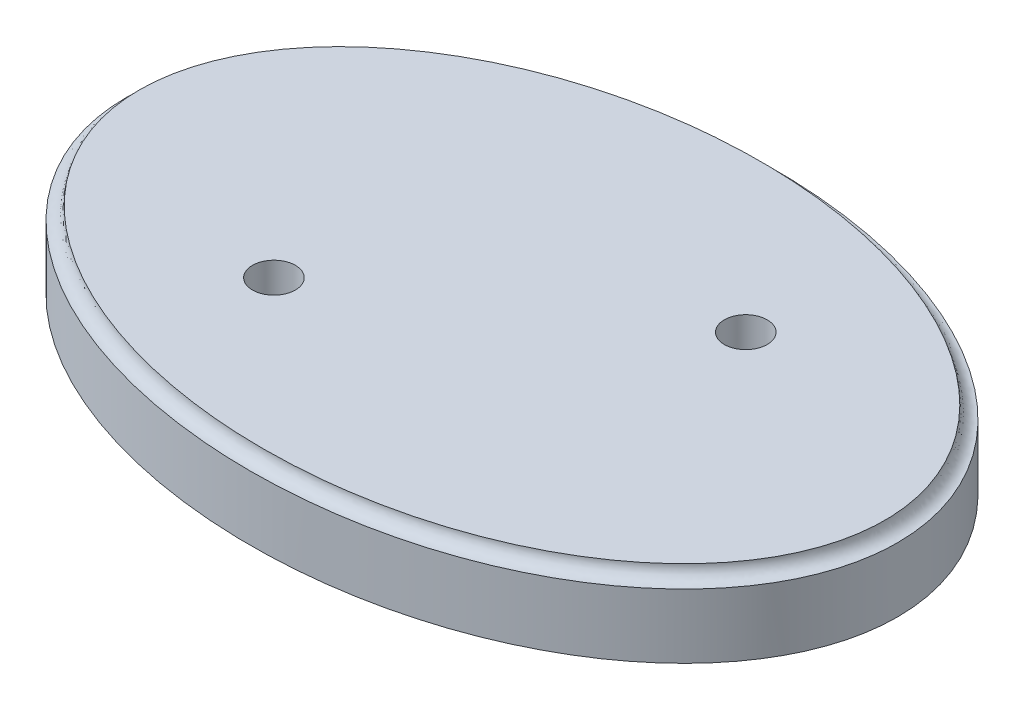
ISO-10303-21;
HEADER;
FILE_DESCRIPTION(('STEP AP214'),'2;1');
FILE_NAME('part.step','',(''),(''),'','','');
FILE_SCHEMA(('AUTOMOTIVE_DESIGN { 1 0 10303 214 1 1 1 1 }'));
ENDSEC;
DATA;
#1=APPLICATION_CONTEXT('core data for automotive mechanical design processes');
#2=APPLICATION_PROTOCOL_DEFINITION('international standard','automotive_design',2000,#1);
#3=PRODUCT_CONTEXT('',#1,'mechanical');
#4=PRODUCT('Part','Part','',(#3));
#5=PRODUCT_RELATED_PRODUCT_CATEGORY('part','',(#4));
#6=PRODUCT_DEFINITION_FORMATION('','',#4);
#7=PRODUCT_DEFINITION_CONTEXT('part definition',#1,'design');
#8=PRODUCT_DEFINITION('design','',#6,#7);
#9=PRODUCT_DEFINITION_SHAPE('','',#8);
#10=(LENGTH_UNIT() NAMED_UNIT(*) SI_UNIT(.MILLI.,.METRE.));
#11=(NAMED_UNIT(*) PLANE_ANGLE_UNIT() SI_UNIT($,.RADIAN.));
#12=(NAMED_UNIT(*) SI_UNIT($,.STERADIAN.) SOLID_ANGLE_UNIT());
#13=UNCERTAINTY_MEASURE_WITH_UNIT(LENGTH_MEASURE(1.E-05),#10,'distance_accuracy_value','');
#14=(GEOMETRIC_REPRESENTATION_CONTEXT(3) GLOBAL_UNCERTAINTY_ASSIGNED_CONTEXT((#13)) GLOBAL_UNIT_ASSIGNED_CONTEXT((#10,
#11,#12)) REPRESENTATION_CONTEXT('',''));
#15=CARTESIAN_POINT('',(0.,0.,0.));
#16=DIRECTION('',(0.,0.,1.));
#17=DIRECTION('',(1.,0.,0.));
#18=AXIS2_PLACEMENT_3D('',#15,#16,#17);
#19=CARTESIAN_POINT('',(0.,-9.,0.));
#20=DIRECTION('',(0.,1.,0.));
#21=DIRECTION('',(1.,0.,0.));
#22=AXIS2_PLACEMENT_3D('',#19,#20,#21);
#23=ELLIPSE('',#22,44.95,30.5);
#24=DIRECTION('',(0.,1.,0.));
#25=VECTOR('',#24,1.);
#26=SURFACE_OF_LINEAR_EXTRUSION('',#23,#25);
#27=CARTESIAN_POINT('',(44.95,-1.5,0.));
#28=CARTESIAN_POINT('',(44.9499991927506,-1.50000000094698,-0.501674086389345));
#29=CARTESIAN_POINT('',(44.9317312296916,-1.49999999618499,-1.00335822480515));
#30=CARTESIAN_POINT('',(44.8771406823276,-1.49999998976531,-1.75387784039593));
#31=CARTESIAN_POINT('',(44.854404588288,-1.49999998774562,-2.00377010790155));
#32=CARTESIAN_POINT('',(44.7999421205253,-1.4999999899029,-2.50262636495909));
#33=CARTESIAN_POINT('',(44.7682141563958,-1.49999999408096,-2.75159018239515));
#34=CARTESIAN_POINT('',(44.6871727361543,-1.49999999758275,-3.30795151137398));
#35=CARTESIAN_POINT('',(44.6354651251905,-1.49999999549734,-3.61500226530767));
#36=CARTESIAN_POINT('',(44.5186349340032,-1.49999999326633,-4.22655944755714));
#37=CARTESIAN_POINT('',(44.4535112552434,-1.49999999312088,-4.53106566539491));
#38=CARTESIAN_POINT('',(44.3101420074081,-1.49999999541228,-5.13709108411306));
#39=CARTESIAN_POINT('',(44.2318917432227,-1.49999999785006,-5.43860917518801));
#40=CARTESIAN_POINT('',(44.0626537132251,-1.49999999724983,-6.03807295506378));
#41=CARTESIAN_POINT('',(43.9716641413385,-1.49999999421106,-6.33601813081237));
#42=CARTESIAN_POINT('',(43.6798223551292,-1.4999999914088,-7.2249004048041));
#43=CARTESIAN_POINT('',(43.4603498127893,-1.49999999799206,-7.80982372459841));
#44=CARTESIAN_POINT('',(42.9755144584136,-1.49999999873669,-8.96036378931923));
#45=CARTESIAN_POINT('',(42.7101413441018,-1.49999999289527,-9.52597616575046));
#46=CARTESIAN_POINT('',(42.2438099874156,-1.49999999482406,-10.4295399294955));
#47=CARTESIAN_POINT('',(42.0554926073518,-1.49999999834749,-10.7740838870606));
#48=CARTESIAN_POINT('',(41.6633414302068,-1.50000000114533,-11.4540888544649));
#49=CARTESIAN_POINT('',(41.459511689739,-1.50000000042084,-11.7895522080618));
#50=CARTESIAN_POINT('',(40.8259839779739,-1.4999999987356,-12.7821911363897));
#51=CARTESIAN_POINT('',(40.3743170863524,-1.49999999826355,-13.4254819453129));
#52=CARTESIAN_POINT('',(39.4200992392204,-1.49999999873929,-14.6731140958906));
#53=CARTESIAN_POINT('',(38.9175336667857,-1.4999999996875,-15.2774441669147));
#54=CARTESIAN_POINT('',(37.8685669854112,-1.499999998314,-16.4463964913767));
#55=CARTESIAN_POINT('',(37.3221740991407,-1.49999999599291,-17.0110261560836));
#56=CARTESIAN_POINT('',(35.97453450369,-1.49999999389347,-18.3100825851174));
#57=CARTESIAN_POINT('',(35.155935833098,-1.49999999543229,-19.0265447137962));
#58=CARTESIAN_POINT('',(33.4611160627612,-1.49999999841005,-20.3850519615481));
#59=CARTESIAN_POINT('',(32.5849586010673,-1.4999999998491,-21.0271771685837));
#60=CARTESIAN_POINT('',(30.7863331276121,-1.49999999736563,-22.2400042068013));
#61=CARTESIAN_POINT('',(29.863923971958,-1.49999999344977,-22.8107937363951));
#62=CARTESIAN_POINT('',(27.9803753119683,-1.49999999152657,-23.8850413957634));
#63=CARTESIAN_POINT('',(27.0192213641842,-1.49999999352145,-24.3884741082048));
#64=CARTESIAN_POINT('',(25.3504953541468,-1.49999998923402,-25.1933227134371));
#65=CARTESIAN_POINT('',(24.6506250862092,-1.49999998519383,-25.5108637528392));
#66=CARTESIAN_POINT('',(23.237394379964,-1.49999997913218,-26.114419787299));
#67=CARTESIAN_POINT('',(22.5240328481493,-1.49999997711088,-26.4004322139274));
#68=CARTESIAN_POINT('',(20.3663428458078,-1.49999996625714,-27.2126044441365));
#69=CARTESIAN_POINT('',(18.904503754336,-1.49999995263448,-27.6928539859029));
#70=CARTESIAN_POINT('',(15.9497960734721,-1.49999996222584,-28.5360482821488));
#71=CARTESIAN_POINT('',(14.4569672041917,-1.49999998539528,-28.8991343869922));
#72=CARTESIAN_POINT('',(11.4489777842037,-1.49999990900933,-29.5133107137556));
#73=CARTESIAN_POINT('',(9.93382608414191,-1.49999980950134,-29.7644441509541));
#74=CARTESIAN_POINT('',(7.65299183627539,-1.49999979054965,-30.0592669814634));
#75=CARTESIAN_POINT('',(6.89235460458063,-1.49999980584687,-30.143838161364));
#76=CARTESIAN_POINT('',(5.36860555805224,-1.49999987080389,-30.2861771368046));
#77=CARTESIAN_POINT('',(4.60549385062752,-1.49999992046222,-30.3439460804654));
#78=CARTESIAN_POINT('',(2.31050714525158,-1.50000002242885,-30.4775266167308));
#79=CARTESIAN_POINT('',(0.776114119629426,-1.50000002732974,-30.5132092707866));
#80=CARTESIAN_POINT('',(-2.29199331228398,-1.49999997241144,-30.4781183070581));
#81=CARTESIAN_POINT('',(-3.82570714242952,-1.49999991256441,-30.4072988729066));
#82=CARTESIAN_POINT('',(-6.88478738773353,-1.49999984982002,-30.1582420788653));
#83=CARTESIAN_POINT('',(-8.41015179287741,-1.49999984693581,-29.9799799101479));
#84=CARTESIAN_POINT('',(-11.4435274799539,-1.4999998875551,-29.5139080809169));
#85=CARTESIAN_POINT('',(-12.9515471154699,-1.49999993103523,-29.2261536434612));
#86=CARTESIAN_POINT('',(-15.1921332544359,-1.49999994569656,-28.7101624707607));
#87=CARTESIAN_POINT('',(-15.9346492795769,-1.49999994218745,-28.5243458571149));
#88=CARTESIAN_POINT('',(-17.4119698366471,-1.49999995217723,-28.1239614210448));
#89=CARTESIAN_POINT('',(-18.1467733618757,-1.49999996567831,-27.9093898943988));
#90=CARTESIAN_POINT('',(-20.2576195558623,-1.49999998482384,-27.246625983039));
#91=CARTESIAN_POINT('',(-21.6221273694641,-1.49999997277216,-26.760517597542));
#92=CARTESIAN_POINT('',(-23.6353965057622,-1.49999997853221,-25.9486702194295));
#93=CARTESIAN_POINT('',(-24.3010711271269,-1.49999998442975,-25.664189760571));
#94=CARTESIAN_POINT('',(-25.6195477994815,-1.49999999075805,-25.0668526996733));
#95=CARTESIAN_POINT('',(-26.2723506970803,-1.49999999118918,-24.7539979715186));
#96=CARTESIAN_POINT('',(-27.9723802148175,-1.49999999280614,-23.8914751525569));
#97=CARTESIAN_POINT('',(-29.0073735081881,-1.49999999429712,-23.3173843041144));
#98=CARTESIAN_POINT('',(-31.0270603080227,-1.49999999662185,-22.0878803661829));
#99=CARTESIAN_POINT('',(-32.0117926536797,-1.49999999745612,-21.4325314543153));
#100=CARTESIAN_POINT('',(-33.7545487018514,-1.49999999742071,-20.1568507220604));
#101=CARTESIAN_POINT('',(-34.5223945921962,-1.49999999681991,-19.5499506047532));
#102=CARTESIAN_POINT('',(-36.0077835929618,-1.49999999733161,-18.2747926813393));
#103=CARTESIAN_POINT('',(-36.7252471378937,-1.49999999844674,-17.606441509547));
#104=CARTESIAN_POINT('',(-37.996934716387,-1.49999999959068,-16.3109045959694));
#105=CARTESIAN_POINT('',(-38.5596621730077,-1.4999999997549,-15.6920744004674));
#106=CARTESIAN_POINT('',(-39.6320906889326,-1.5000000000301,-14.4095052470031));
#107=CARTESIAN_POINT('',(-40.1417765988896,-1.50000000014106,-13.7457535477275));
#108=CARTESIAN_POINT('',(-41.098681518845,-1.4999999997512,-12.3754959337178));
#109=CARTESIAN_POINT('',(-41.5459648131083,-1.499999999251,-11.6690351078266));
#110=CARTESIAN_POINT('',(-42.3691369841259,-1.49999999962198,-10.2157497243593));
#111=CARTESIAN_POINT('',(-42.7450588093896,-1.50000000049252,-9.46894400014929));
#112=CARTESIAN_POINT('',(-43.3250463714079,-1.49999999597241,-8.14739331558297));
#113=CARTESIAN_POINT('',(-43.5480697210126,-1.49999999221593,-7.58091929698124));
#114=CARTESIAN_POINT('',(-43.9477688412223,-1.49999999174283,-6.4318402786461));
#115=CARTESIAN_POINT('',(-44.1244515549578,-1.49999999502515,-5.84923770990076));
#116=CARTESIAN_POINT('',(-44.4283108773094,-1.49999999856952,-4.671686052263));
#117=CARTESIAN_POINT('',(-44.5555241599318,-1.49999999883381,-4.07674645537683));
#118=CARTESIAN_POINT('',(-44.7582569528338,-1.49999999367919,-2.87807120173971));
#119=CARTESIAN_POINT('',(-44.8337752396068,-1.49999998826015,-2.27433533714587));
#120=CARTESIAN_POINT('',(-44.931756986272,-1.49999999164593,-1.06078642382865));
#121=CARTESIAN_POINT('',(-44.9540654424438,-1.50000000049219,-0.450960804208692));
#122=CARTESIAN_POINT('',(-44.9447182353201,-1.49999999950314,0.768273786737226));
#123=CARTESIAN_POINT('',(-44.9130626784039,-1.49999998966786,1.37768275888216));
#124=CARTESIAN_POINT('',(-44.7964246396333,-1.49999998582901,2.59146005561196));
#125=CARTESIAN_POINT('',(-44.7114328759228,-1.49999999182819,3.19582748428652));
#126=CARTESIAN_POINT('',(-44.48979230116,-1.49999999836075,4.39498120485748));
#127=CARTESIAN_POINT('',(-44.3531434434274,-1.49999999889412,4.9897674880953));
#128=CARTESIAN_POINT('',(-44.0363930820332,-1.49999999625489,6.14519975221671));
#129=CARTESIAN_POINT('',(-43.857982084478,-1.4999999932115,6.70631170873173));
#130=CARTESIAN_POINT('',(-43.4582903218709,-1.49999999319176,7.81297574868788));
#131=CARTESIAN_POINT('',(-43.2370116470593,-1.4999999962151,8.35852858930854));
#132=CARTESIAN_POINT('',(-42.7546764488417,-1.49999999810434,9.43194091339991));
#133=CARTESIAN_POINT('',(-42.4936047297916,-1.49999999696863,9.95979354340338));
#134=CARTESIAN_POINT('',(-41.9350079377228,-1.4999999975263,10.9959565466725));
#135=CARTESIAN_POINT('',(-41.6374750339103,-1.49999999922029,11.5042626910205));
#136=CARTESIAN_POINT('',(-41.0964360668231,-1.50000000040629,12.3619148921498));
#137=CARTESIAN_POINT('',(-40.8608121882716,-1.50000000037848,12.7162709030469));
#138=CARTESIAN_POINT('',(-40.3735671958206,-1.4999999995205,13.4136810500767));
#139=CARTESIAN_POINT('',(-40.1219491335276,-1.49999999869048,13.7567373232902));
#140=CARTESIAN_POINT('',(-39.3445662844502,-1.49999999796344,14.7690237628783));
#141=CARTESIAN_POINT('',(-38.7963867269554,-1.4999999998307,15.421192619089));
#142=CARTESIAN_POINT('',(-37.6487004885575,-1.49999999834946,16.6795867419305));
#143=CARTESIAN_POINT('',(-37.0491385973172,-1.49999999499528,17.2857612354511));
#144=CARTESIAN_POINT('',(-35.8069091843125,-1.49999999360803,18.4517137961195));
#145=CARTESIAN_POINT('',(-35.1642506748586,-1.49999999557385,19.0115015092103));
#146=CARTESIAN_POINT('',(-33.5732172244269,-1.49999999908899,20.3044008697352));
#147=CARTESIAN_POINT('',(-32.6068239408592,-1.50000000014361,21.0153887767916));
#148=CARTESIAN_POINT('',(-30.6178789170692,-1.49999999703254,22.3504155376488));
#149=CARTESIAN_POINT('',(-29.5953929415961,-1.49999999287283,22.9745533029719));
#150=CARTESIAN_POINT('',(-27.5060186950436,-1.49999999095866,24.1403682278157));
#151=CARTESIAN_POINT('',(-26.4391767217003,-1.49999999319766,24.6821287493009));
#152=CARTESIAN_POINT('',(-24.2695450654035,-1.49999998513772,25.6877595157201));
#153=CARTESIAN_POINT('',(-23.16675440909,-1.49999997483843,26.1516276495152));
#154=CARTESIAN_POINT('',(-20.9360533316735,-1.49999997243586,27.0036657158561));
#155=CARTESIAN_POINT('',(-19.8082239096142,-1.49999998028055,27.3920486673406));
#156=CARTESIAN_POINT('',(-17.5287746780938,-1.49999996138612,28.0982330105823));
#157=CARTESIAN_POINT('',(-16.3771194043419,-1.49999993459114,28.4159194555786));
#158=CARTESIAN_POINT('',(-14.0567152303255,-1.49999993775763,28.98237509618));
#159=CARTESIAN_POINT('',(-12.8879617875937,-1.49999996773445,29.2311256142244));
#160=CARTESIAN_POINT('',(-10.5387832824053,-1.49999989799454,29.6613517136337));
#161=CARTESIAN_POINT('',(-9.35836421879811,-1.49999979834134,29.8428601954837));
#162=CARTESIAN_POINT('',(-6.98918585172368,-1.49999978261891,30.1401390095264));
#163=CARTESIAN_POINT('',(-5.80042593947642,-1.49999986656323,30.2559044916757));
#164=CARTESIAN_POINT('',(-3.70279929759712,-1.49999996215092,30.4026304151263));
#165=CARTESIAN_POINT('',(-2.79485901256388,-1.49999998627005,30.44723819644));
#166=CARTESIAN_POINT('',(-0.977837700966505,-1.50000000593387,30.4990245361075));
#167=CARTESIAN_POINT('',(-0.0687566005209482,-1.50000000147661,30.5062005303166));
#168=CARTESIAN_POINT('',(1.74919626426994,-1.49999999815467,30.4831417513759));
#169=CARTESIAN_POINT('',(2.65806790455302,-1.49999999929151,30.4528968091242));
#170=CARTESIAN_POINT('',(4.4736783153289,-1.4999999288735,30.3548572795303));
#171=CARTESIAN_POINT('',(5.38041714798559,-1.49999985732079,30.287063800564));
#172=CARTESIAN_POINT('',(8.00578894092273,-1.49999977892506,30.03550416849));
#173=CARTESIAN_POINT('',(9.7201013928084,-1.49999988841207,29.8022795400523));
#174=CARTESIAN_POINT('',(12.2721532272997,-1.49999994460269,29.347338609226));
#175=CARTESIAN_POINT('',(13.1196224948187,-1.49999994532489,29.1781686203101));
#176=CARTESIAN_POINT('',(14.8066132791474,-1.49999994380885,28.8040838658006));
#177=CARTESIAN_POINT('',(15.6461350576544,-1.49999994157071,28.5991702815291));
#178=CARTESIAN_POINT('',(17.930226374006,-1.49999995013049,27.9884002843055));
#179=CARTESIAN_POINT('',(19.3652485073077,-1.49999997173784,27.5456662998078));
#180=CARTESIAN_POINT('',(21.4867229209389,-1.49999997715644,26.7952059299));
#181=CARTESIAN_POINT('',(22.1887202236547,-1.49999997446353,26.5306522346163));
#182=CARTESIAN_POINT('',(23.5808080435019,-1.49999997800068,25.9719205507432));
#183=CARTESIAN_POINT('',(24.2708992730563,-1.4999999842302,25.6777443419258));
#184=CARTESIAN_POINT('',(26.0908424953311,-1.49999999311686,24.853521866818));
#185=CARTESIAN_POINT('',(27.208643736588,-1.49999999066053,24.2964919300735));
#186=CARTESIAN_POINT('',(29.3956586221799,-1.49999999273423,23.0938008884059));
#187=CARTESIAN_POINT('',(30.4648771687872,-1.49999999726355,22.4481487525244));
#188=CARTESIAN_POINT('',(32.3597647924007,-1.49999999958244,21.1848653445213));
#189=CARTESIAN_POINT('',(33.1953239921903,-1.49999999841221,20.5820826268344));
#190=CARTESIAN_POINT('',(34.8145779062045,-1.49999999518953,19.3110994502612));
#191=CARTESIAN_POINT('',(35.5983085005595,-1.4999999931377,18.6429450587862));
#192=CARTESIAN_POINT('',(36.9788528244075,-1.49999999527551,17.355129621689));
#193=CARTESIAN_POINT('',(37.5851697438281,-1.49999999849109,16.7456601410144));
#194=CARTESIAN_POINT('',(38.7473377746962,-1.49999999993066,15.4782261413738));
#195=CARTESIAN_POINT('',(39.3031049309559,-1.49999999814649,14.8201841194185));
#196=CARTESIAN_POINT('',(40.2860502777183,-1.49999999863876,13.5453455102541));
#197=CARTESIAN_POINT('',(40.7205639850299,-1.50000000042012,12.9342126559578));
#198=CARTESIAN_POINT('',(41.537279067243,-1.49999999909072,11.6774824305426));
#199=CARTESIAN_POINT('',(41.9194610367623,-1.49999999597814,11.0318723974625));
#200=CARTESIAN_POINT('',(42.6237182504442,-1.49999999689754,9.71013083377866));
#201=CARTESIAN_POINT('',(42.9459201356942,-1.50000000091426,9.03406744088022));
#202=CARTESIAN_POINT('',(43.379562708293,-1.49999999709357,7.99964021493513));
#203=CARTESIAN_POINT('',(43.5158107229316,-1.49999999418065,7.65151575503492));
#204=CARTESIAN_POINT('',(43.7710330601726,-1.49999999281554,6.94901239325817));
#205=CARTESIAN_POINT('',(43.8900104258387,-1.49999999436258,6.59463460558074));
#206=CARTESIAN_POINT('',(44.0767883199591,-1.49999999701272,5.98803193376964));
#207=CARTESIAN_POINT('',(44.1492040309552,-1.49999999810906,5.73721801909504));
#208=CARTESIAN_POINT('',(44.2850045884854,-1.49999999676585,5.23320955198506));
#209=CARTESIAN_POINT('',(44.3483909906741,-1.49999999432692,4.98001541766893));
#210=CARTESIAN_POINT('',(44.5246493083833,-1.49999999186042,4.21742990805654));
#211=CARTESIAN_POINT('',(44.6237038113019,-1.49999999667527,3.70476525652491));
#212=CARTESIAN_POINT('',(44.785314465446,-1.49999999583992,2.661791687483));
#213=CARTESIAN_POINT('',(44.8469892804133,-1.4999999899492,2.13134666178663));
#214=CARTESIAN_POINT('',(44.929332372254,-1.49999999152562,1.06727153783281));
#215=CARTESIAN_POINT('',(44.9500008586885,-1.49999999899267,0.53364145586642));
#216=CARTESIAN_POINT('',(44.95,-1.5,0.));
#217=B_SPLINE_CURVE_WITH_KNOTS('',3,(#27,#28,#29,#30,#31,#32,#33,#34,#35,#36,#37,#38,#39,#40,
#41,#42,#43,#44,#45,#46,#47,#48,#49,#50,#51,#52,#53,#54,#55,#56,#57,#58,#59,#60,#61,#62,#63,#64,
#65,#66,#67,#68,#69,#70,#71,#72,#73,#74,#75,#76,#77,#78,#79,#80,#81,#82,#83,#84,#85,#86,#87,#88,
#89,#90,#91,#92,#93,#94,#95,#96,#97,#98,#99,#100,#101,#102,#103,#104,#105,#106,#107,#108,#109,
#110,#111,#112,#113,#114,#115,#116,#117,#118,#119,#120,#121,#122,#123,#124,#125,#126,#127,#128,
#129,#130,#131,#132,#133,#134,#135,#136,#137,#138,#139,#140,#141,#142,#143,#144,#145,#146,#147,
#148,#149,#150,#151,#152,#153,#154,#155,#156,#157,#158,#159,#160,#161,#162,#163,#164,#165,#166,
#167,#168,#169,#170,#171,#172,#173,#174,#175,#176,#177,#178,#179,#180,#181,#182,#183,#184,#185,
#186,#187,#188,#189,#190,#191,#192,#193,#194,#195,#196,#197,#198,#199,#200,#201,#202,#203,#204,
#205,#206,#207,#208,#209,#210,#211,#212,#213,#214,#215,#216),.UNSPECIFIED.,.T.,.F.,(4,2,2,2,2,2,
2,2,2,2,2,2,2,2,2,2,2,2,2,2,2,2,2,2,2,2,2,2,2,2,2,2,2,2,2,2,2,2,2,2,2,2,2,2,2,2,2,2,2,2,2,2,2,2,
2,2,2,2,2,2,2,2,2,2,2,2,2,2,2,2,2,2,2,2,2,2,2,2,2,2,2,2,2,2,2,2,2,2,2,2,2,2,2,2,4),(0.,
1.50462597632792,2.25726256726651,3.01003236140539,3.94384245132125,4.87772903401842,
5.81195036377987,6.74630427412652,8.61827231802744,10.4906610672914,11.6682161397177,
12.8454643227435,15.2004110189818,17.5560359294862,19.9112199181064,23.169978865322,
26.4251936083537,29.6763662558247,32.9287623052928,35.2336205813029,37.5386664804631,
42.1490722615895,46.7538948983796,51.3569384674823,53.6525120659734,55.9479873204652,
60.5483947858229,65.1507818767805,69.7542320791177,74.3553635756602,76.6510901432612,
78.9471127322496,83.2872833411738,85.4584865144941,87.6295464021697,91.1765566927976,
94.720783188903,97.6541609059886,100.592071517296,103.098782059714,105.606206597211,
108.111028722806,110.614691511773,112.439289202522,114.263613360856,116.086582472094,
117.909594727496,119.73791108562,121.566223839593,123.394854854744,125.223487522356,
126.98803980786,128.75250607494,130.517647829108,132.283169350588,133.559351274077,
134.835290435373,137.387802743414,139.943092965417,142.49785048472,146.091835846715,
149.681694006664,153.267894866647,156.854192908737,160.430218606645,164.012016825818,
167.594784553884,171.175796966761,174.757073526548,177.483447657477,180.210008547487,
182.937310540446,185.66453203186,190.848135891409,193.440070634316,196.031919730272,
200.531768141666,202.781794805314,205.031686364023,208.774530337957,212.516995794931,
215.604924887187,218.690693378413,221.267265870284,223.848042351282,226.095218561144,
228.343225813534,230.586431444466,231.707575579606,232.828521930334,233.611539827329,
234.394422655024,235.959341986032,237.55985299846,239.160355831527),.UNSPECIFIED.);
#218=CARTESIAN_POINT('',(44.95,-1.5,0.));
#219=VERTEX_POINT('',#218);
#220=EDGE_CURVE('E60',#219,#219,#217,.T.);
#221=ORIENTED_EDGE('',*,*,#220,.F.);
#222=EDGE_LOOP('',(#221));
#223=FACE_BOUND('',#222,.T.);
#224=CARTESIAN_POINT('',(44.95,-9.,0.));
#225=VERTEX_POINT('',#224);
#226=EDGE_CURVE('E12',#225,#225,#23,.T.);
#227=ORIENTED_EDGE('',*,*,#226,.T.);
#228=EDGE_LOOP('',(#227));
#229=FACE_BOUND('',#228,.T.);
#230=ADVANCED_FACE('F50',(#223,#229),#26,.T.);
#231=CARTESIAN_POINT('',(0.,-9.,0.));
#232=DIRECTION('',(0.,1.,0.));
#233=DIRECTION('',(0.,0.,1.));
#234=AXIS2_PLACEMENT_3D('',#231,#232,#233);
#235=PLANE('',#234);
#236=CARTESIAN_POINT('',(16.35,-9.,-10.9));
#237=DIRECTION('',(0.,-1.,0.));
#238=DIRECTION('',(0.,0.,-1.));
#239=AXIS2_PLACEMENT_3D('',#236,#237,#238);
#240=CIRCLE('',#239,4.);
#241=CARTESIAN_POINT('',(16.35,-9.,-14.9));
#242=VERTEX_POINT('',#241);
#243=EDGE_CURVE('E185',#242,#242,#240,.T.);
#244=ORIENTED_EDGE('',*,*,#243,.F.);
#245=EDGE_LOOP('',(#244));
#246=FACE_BOUND('',#245,.T.);
#247=CARTESIAN_POINT('',(-16.65,-9.,11.1));
#248=DIRECTION('',(0.,-1.,0.));
#249=DIRECTION('',(0.,0.,-1.));
#250=AXIS2_PLACEMENT_3D('',#247,#248,#249);
#251=CIRCLE('',#250,4.);
#252=CARTESIAN_POINT('',(-16.65,-9.,7.1));
#253=VERTEX_POINT('',#252);
#254=EDGE_CURVE('E175',#253,#253,#251,.T.);
#255=ORIENTED_EDGE('',*,*,#254,.F.);
#256=EDGE_LOOP('',(#255));
#257=FACE_BOUND('',#256,.T.);
#258=CARTESIAN_POINT('',(-26.75,-9.,15.6));
#259=DIRECTION('',(0.,-1.,0.));
#260=DIRECTION('',(0.,0.,-1.));
#261=AXIS2_PLACEMENT_3D('',#258,#259,#260);
#262=CIRCLE('',#261,2.5);
#263=CARTESIAN_POINT('',(-26.75,-9.,13.1));
#264=VERTEX_POINT('',#263);
#265=EDGE_CURVE('E90',#264,#264,#262,.T.);
#266=ORIENTED_EDGE('',*,*,#265,.F.);
#267=EDGE_LOOP('',(#266));
#268=FACE_BOUND('',#267,.T.);
#269=CARTESIAN_POINT('',(-26.75,-9.,-15.2));
#270=DIRECTION('',(0.,-1.,0.));
#271=DIRECTION('',(0.,0.,-1.));
#272=AXIS2_PLACEMENT_3D('',#269,#270,#271);
#273=CIRCLE('',#272,2.5);
#274=CARTESIAN_POINT('',(-26.75,-9.,-17.7));
#275=VERTEX_POINT('',#274);
#276=EDGE_CURVE('E83',#275,#275,#273,.T.);
#277=ORIENTED_EDGE('',*,*,#276,.F.);
#278=EDGE_LOOP('',(#277));
#279=FACE_BOUND('',#278,.T.);
#280=CARTESIAN_POINT('',(26.75,-9.,-15.2));
#281=DIRECTION('',(0.,-1.,0.));
#282=DIRECTION('',(0.,0.,-1.));
#283=AXIS2_PLACEMENT_3D('',#280,#281,#282);
#284=CIRCLE('',#283,2.5);
#285=CARTESIAN_POINT('',(26.75,-9.,-17.7));
#286=VERTEX_POINT('',#285);
#287=EDGE_CURVE('E99',#286,#286,#284,.T.);
#288=ORIENTED_EDGE('',*,*,#287,.F.);
#289=EDGE_LOOP('',(#288));
#290=FACE_BOUND('',#289,.T.);
#291=CARTESIAN_POINT('',(26.75,-9.,16.9321592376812));
#292=DIRECTION('',(0.,-1.,0.));
#293=DIRECTION('',(0.,0.,-1.));
#294=AXIS2_PLACEMENT_3D('',#291,#292,#293);
#295=CIRCLE('',#294,2.5);
#296=CARTESIAN_POINT('',(26.75,-9.,14.4321592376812));
#297=VERTEX_POINT('',#296);
#298=EDGE_CURVE('E108',#297,#297,#295,.T.);
#299=ORIENTED_EDGE('',*,*,#298,.F.);
#300=EDGE_LOOP('',(#299));
#301=FACE_BOUND('',#300,.T.);
#302=ORIENTED_EDGE('',*,*,#226,.F.);
#303=EDGE_LOOP('',(#302));
#304=FACE_BOUND('',#303,.T.);
#305=ADVANCED_FACE('F132',(#246,#257,#268,#279,#290,#301,#304),#235,.F.);
#306=CARTESIAN_POINT('',(0.,0.,29.));
#307=CARTESIAN_POINT('',(2.66652649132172,0.,29.));
#308=CARTESIAN_POINT('',(7.85447701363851,0.,28.6722642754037));
#309=CARTESIAN_POINT('',(15.0111530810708,0.,27.3464465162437));
#310=CARTESIAN_POINT('',(21.308451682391,0.,25.386421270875));
#311=CARTESIAN_POINT('',(26.6535779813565,0.,22.9984251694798));
#312=CARTESIAN_POINT('',(31.0490854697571,0.,20.3681146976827));
#313=CARTESIAN_POINT('',(34.5628501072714,0.,17.6457736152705));
#314=CARTESIAN_POINT('',(37.4436833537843,0.,14.798958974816));
#315=CARTESIAN_POINT('',(39.6859356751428,0.,11.9141741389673));
#316=CARTESIAN_POINT('',(41.3262809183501,0.,9.07474310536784));
#317=CARTESIAN_POINT('',(42.4068271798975,0.,6.46195389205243));
#318=CARTESIAN_POINT('',(43.0598088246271,0.,4.08037951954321));
#319=CARTESIAN_POINT('',(43.3902711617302,0.,1.92221492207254));
#320=CARTESIAN_POINT('',(43.45,0.,0.615246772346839));
#321=CARTESIAN_POINT('',(43.4500000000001,0.,-0.615246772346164));
#322=CARTESIAN_POINT('',(43.3902711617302,0.,-1.92221492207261));
#323=CARTESIAN_POINT('',(43.059808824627,0.,-4.08037951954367));
#324=CARTESIAN_POINT('',(42.4068271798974,0.,-6.46195389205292));
#325=CARTESIAN_POINT('',(41.32628091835,0.,-9.07474310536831));
#326=CARTESIAN_POINT('',(39.6859356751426,0.,-11.9141741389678));
#327=CARTESIAN_POINT('',(37.4436833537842,0.,-14.7989589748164));
#328=CARTESIAN_POINT('',(34.5628501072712,0.,-17.6457736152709));
#329=CARTESIAN_POINT('',(31.049085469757,0.,-20.368114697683));
#330=CARTESIAN_POINT('',(26.6535779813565,0.,-22.9984251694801));
#331=CARTESIAN_POINT('',(21.3084516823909,0.,-25.3864212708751));
#332=CARTESIAN_POINT('',(15.0111530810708,0.,-27.3464465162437));
#333=CARTESIAN_POINT('',(7.85447701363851,0.,-28.6722642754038));
#334=CARTESIAN_POINT('',(2.66652649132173,0.,-29.));
#335=CARTESIAN_POINT('',(-2.66652649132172,0.,-29.));
#336=CARTESIAN_POINT('',(-7.85447701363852,0.,-28.6722642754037));
#337=CARTESIAN_POINT('',(-15.0111530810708,0.,-27.3464465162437));
#338=CARTESIAN_POINT('',(-21.3084516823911,0.,-25.386421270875));
#339=CARTESIAN_POINT('',(-26.6535779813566,0.,-22.9984251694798));
#340=CARTESIAN_POINT('',(-31.0490854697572,0.,-20.3681146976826));
#341=CARTESIAN_POINT('',(-34.5628501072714,0.,-17.6457736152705));
#342=CARTESIAN_POINT('',(-37.4436833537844,0.,-14.798958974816));
#343=CARTESIAN_POINT('',(-39.6859356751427,0.,-11.9141741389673));
#344=CARTESIAN_POINT('',(-41.3262809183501,0.,-9.07474310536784));
#345=CARTESIAN_POINT('',(-42.4068271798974,0.,-6.46195389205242));
#346=CARTESIAN_POINT('',(-43.0598088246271,0.,-4.08037951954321));
#347=CARTESIAN_POINT('',(-43.3902711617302,0.,-1.92221492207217));
#348=CARTESIAN_POINT('',(-43.45,0.,-0.615246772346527));
#349=CARTESIAN_POINT('',(-43.45,0.,0.615246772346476));
#350=CARTESIAN_POINT('',(-43.3902711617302,0.,1.92221492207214));
#351=CARTESIAN_POINT('',(-43.0598088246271,0.,4.08037951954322));
#352=CARTESIAN_POINT('',(-42.4068271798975,0.,6.46195389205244));
#353=CARTESIAN_POINT('',(-41.3262809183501,0.,9.07474310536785));
#354=CARTESIAN_POINT('',(-39.6859356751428,0.,11.9141741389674));
#355=CARTESIAN_POINT('',(-37.4436833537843,0.,14.798958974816));
#356=CARTESIAN_POINT('',(-34.5628501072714,0.,17.6457736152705));
#357=CARTESIAN_POINT('',(-31.049085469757,0.,20.3681146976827));
#358=CARTESIAN_POINT('',(-26.6535779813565,0.,22.9984251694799));
#359=CARTESIAN_POINT('',(-21.3084516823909,0.,25.386421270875));
#360=CARTESIAN_POINT('',(-15.0111530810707,0.,27.3464465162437));
#361=CARTESIAN_POINT('',(-7.85447701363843,0.,28.6722642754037));
#362=CARTESIAN_POINT('',(-2.66652649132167,0.,29.));
#363=CARTESIAN_POINT('',(0.,0.,29.));
#364=CARTESIAN_POINT('',(0.,3.,29.));
#365=CARTESIAN_POINT('',(2.66652649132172,3.,29.));
#366=CARTESIAN_POINT('',(7.85447701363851,3.,28.6722642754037));
#367=CARTESIAN_POINT('',(15.0111530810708,3.,27.3464465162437));
#368=CARTESIAN_POINT('',(21.308451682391,3.,25.386421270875));
#369=CARTESIAN_POINT('',(26.6535779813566,3.,22.9984251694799));
#370=CARTESIAN_POINT('',(31.0490854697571,3.,20.3681146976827));
#371=CARTESIAN_POINT('',(34.5628501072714,3.,17.6457736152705));
#372=CARTESIAN_POINT('',(37.4436833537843,3.,14.798958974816));
#373=CARTESIAN_POINT('',(39.6859356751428,3.,11.9141741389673));
#374=CARTESIAN_POINT('',(41.3262809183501,3.,9.07474310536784));
#375=CARTESIAN_POINT('',(42.4068271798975,3.,6.46195389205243));
#376=CARTESIAN_POINT('',(43.0598088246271,3.,4.08037951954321));
#377=CARTESIAN_POINT('',(43.3902711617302,3.,1.92221492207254));
#378=CARTESIAN_POINT('',(43.45,3.,0.615246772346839));
#379=CARTESIAN_POINT('',(43.45,3.,-0.615246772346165));
#380=CARTESIAN_POINT('',(43.3902711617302,3.,-1.92221492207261));
#381=CARTESIAN_POINT('',(43.059808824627,3.,-4.08037951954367));
#382=CARTESIAN_POINT('',(42.4068271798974,3.,-6.46195389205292));
#383=CARTESIAN_POINT('',(41.32628091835,3.,-9.07474310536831));
#384=CARTESIAN_POINT('',(39.6859356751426,3.,-11.9141741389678));
#385=CARTESIAN_POINT('',(37.4436833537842,3.,-14.7989589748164));
#386=CARTESIAN_POINT('',(34.5628501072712,3.,-17.6457736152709));
#387=CARTESIAN_POINT('',(31.049085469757,3.,-20.368114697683));
#388=CARTESIAN_POINT('',(26.6535779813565,3.,-22.9984251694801));
#389=CARTESIAN_POINT('',(21.3084516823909,3.,-25.3864212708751));
#390=CARTESIAN_POINT('',(15.0111530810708,3.,-27.3464465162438));
#391=CARTESIAN_POINT('',(7.85447701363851,3.,-28.6722642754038));
#392=CARTESIAN_POINT('',(2.66652649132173,3.,-29.));
#393=CARTESIAN_POINT('',(-2.66652649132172,3.,-29.));
#394=CARTESIAN_POINT('',(-7.85447701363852,3.,-28.6722642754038));
#395=CARTESIAN_POINT('',(-15.0111530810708,3.,-27.3464465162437));
#396=CARTESIAN_POINT('',(-21.3084516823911,3.,-25.386421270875));
#397=CARTESIAN_POINT('',(-26.6535779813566,3.,-22.9984251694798));
#398=CARTESIAN_POINT('',(-31.0490854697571,3.,-20.3681146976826));
#399=CARTESIAN_POINT('',(-34.5628501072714,3.,-17.6457736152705));
#400=CARTESIAN_POINT('',(-37.4436833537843,3.,-14.798958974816));
#401=CARTESIAN_POINT('',(-39.6859356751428,3.,-11.9141741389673));
#402=CARTESIAN_POINT('',(-41.3262809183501,3.,-9.07474310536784));
#403=CARTESIAN_POINT('',(-42.4068271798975,3.,-6.46195389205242));
#404=CARTESIAN_POINT('',(-43.0598088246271,3.,-4.08037951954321));
#405=CARTESIAN_POINT('',(-43.3902711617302,3.,-1.92221492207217));
#406=CARTESIAN_POINT('',(-43.45,3.,-0.615246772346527));
#407=CARTESIAN_POINT('',(-43.45,3.,0.615246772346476));
#408=CARTESIAN_POINT('',(-43.3902711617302,3.,1.92221492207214));
#409=CARTESIAN_POINT('',(-43.0598088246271,3.,4.08037951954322));
#410=CARTESIAN_POINT('',(-42.4068271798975,3.,6.46195389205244));
#411=CARTESIAN_POINT('',(-41.3262809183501,3.,9.07474310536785));
#412=CARTESIAN_POINT('',(-39.6859356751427,3.,11.9141741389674));
#413=CARTESIAN_POINT('',(-37.4436833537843,3.,14.798958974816));
#414=CARTESIAN_POINT('',(-34.5628501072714,3.,17.6457736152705));
#415=CARTESIAN_POINT('',(-31.049085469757,3.,20.3681146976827));
#416=CARTESIAN_POINT('',(-26.6535779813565,3.,22.9984251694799));
#417=CARTESIAN_POINT('',(-21.3084516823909,3.,25.386421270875));
#418=CARTESIAN_POINT('',(-15.0111530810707,3.,27.3464465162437));
#419=CARTESIAN_POINT('',(-7.85447701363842,3.,28.6722642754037));
#420=CARTESIAN_POINT('',(-2.66652649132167,3.,29.));
#421=CARTESIAN_POINT('',(0.,3.,29.));
#422=CARTESIAN_POINT('',(0.,3.,32.));
#423=CARTESIAN_POINT('',(2.78865638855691,3.,32.));
#424=CARTESIAN_POINT('',(8.22086670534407,3.,31.6570949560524));
#425=CARTESIAN_POINT('',(15.7275575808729,3.,30.2668007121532));
#426=CARTESIAN_POINT('',(22.3639367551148,3.,28.2020903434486));
#427=CARTESIAN_POINT('',(28.0344209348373,3.,25.6697076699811));
#428=CARTESIAN_POINT('',(32.7383645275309,3.,22.855996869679));
#429=CARTESIAN_POINT('',(36.5382625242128,3.,19.9132181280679));
#430=CARTESIAN_POINT('',(39.6910919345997,3.,16.7989778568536));
#431=CARTESIAN_POINT('',(42.1782440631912,3.,13.6009183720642));
#432=CARTESIAN_POINT('',(44.022234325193,3.,10.4105761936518));
#433=CARTESIAN_POINT('',(45.2510312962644,3.,7.44031569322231));
#434=CARTESIAN_POINT('',(45.9999803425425,3.,4.70985974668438));
#435=CARTESIAN_POINT('',(46.3810047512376,3.,2.21987789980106));
#436=CARTESIAN_POINT('',(46.45,3.,0.714467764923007));
#437=CARTESIAN_POINT('',(46.4500000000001,3.,-0.714467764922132));
#438=CARTESIAN_POINT('',(46.3810047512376,3.,-2.21987789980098));
#439=CARTESIAN_POINT('',(45.9999803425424,3.,-4.70985974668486));
#440=CARTESIAN_POINT('',(45.2510312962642,3.,-7.44031569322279));
#441=CARTESIAN_POINT('',(44.0222343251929,3.,-10.4105761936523));
#442=CARTESIAN_POINT('',(42.1782440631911,3.,-13.6009183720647));
#443=CARTESIAN_POINT('',(39.6910919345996,3.,-16.7989778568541));
#444=CARTESIAN_POINT('',(36.5382625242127,3.,-19.9132181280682));
#445=CARTESIAN_POINT('',(32.7383645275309,3.,-22.8559968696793));
#446=CARTESIAN_POINT('',(28.0344209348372,3.,-25.6697076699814));
#447=CARTESIAN_POINT('',(22.3639367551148,3.,-28.2020903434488));
#448=CARTESIAN_POINT('',(15.7275575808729,3.,-30.2668007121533));
#449=CARTESIAN_POINT('',(8.22086670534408,3.,-31.6570949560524));
#450=CARTESIAN_POINT('',(2.78865638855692,3.,-32.));
#451=CARTESIAN_POINT('',(-2.78865638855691,3.,-32.));
#452=CARTESIAN_POINT('',(-8.22086670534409,3.,-31.6570949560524));
#453=CARTESIAN_POINT('',(-15.7275575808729,3.,-30.2668007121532));
#454=CARTESIAN_POINT('',(-22.3639367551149,3.,-28.2020903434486));
#455=CARTESIAN_POINT('',(-28.0344209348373,3.,-25.6697076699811));
#456=CARTESIAN_POINT('',(-32.738364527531,3.,-22.855996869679));
#457=CARTESIAN_POINT('',(-36.5382625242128,3.,-19.9132181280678));
#458=CARTESIAN_POINT('',(-39.6910919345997,3.,-16.7989778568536));
#459=CARTESIAN_POINT('',(-42.1782440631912,3.,-13.6009183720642));
#460=CARTESIAN_POINT('',(-44.022234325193,3.,-10.4105761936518));
#461=CARTESIAN_POINT('',(-45.2510312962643,3.,-7.4403156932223));
#462=CARTESIAN_POINT('',(-45.9999803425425,3.,-4.70985974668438));
#463=CARTESIAN_POINT('',(-46.3810047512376,3.,-2.21987789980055));
#464=CARTESIAN_POINT('',(-46.45,3.,-0.714467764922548));
#465=CARTESIAN_POINT('',(-46.45,3.,0.71446776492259));
#466=CARTESIAN_POINT('',(-46.3810047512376,3.,2.2198778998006));
#467=CARTESIAN_POINT('',(-45.9999803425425,3.,4.70985974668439));
#468=CARTESIAN_POINT('',(-45.2510312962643,3.,7.44031569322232));
#469=CARTESIAN_POINT('',(-44.022234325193,3.,10.4105761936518));
#470=CARTESIAN_POINT('',(-42.1782440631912,3.,13.6009183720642));
#471=CARTESIAN_POINT('',(-39.6910919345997,3.,16.7989778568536));
#472=CARTESIAN_POINT('',(-36.5382625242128,3.,19.9132181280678));
#473=CARTESIAN_POINT('',(-32.7383645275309,3.,22.855996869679));
#474=CARTESIAN_POINT('',(-28.0344209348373,3.,25.6697076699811));
#475=CARTESIAN_POINT('',(-22.3639367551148,3.,28.2020903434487));
#476=CARTESIAN_POINT('',(-15.7275575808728,3.,30.2668007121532));
#477=CARTESIAN_POINT('',(-8.22086670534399,3.,31.6570949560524));
#478=CARTESIAN_POINT('',(-2.78865638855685,3.,32.));
#479=CARTESIAN_POINT('',(0.,3.,32.));
#480=CARTESIAN_POINT('',(0.,0.,32.));
#481=CARTESIAN_POINT('',(2.78865638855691,0.,32.));
#482=CARTESIAN_POINT('',(8.22086670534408,0.,31.6570949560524));
#483=CARTESIAN_POINT('',(15.7275575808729,0.,30.2668007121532));
#484=CARTESIAN_POINT('',(22.3639367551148,0.,28.2020903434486));
#485=CARTESIAN_POINT('',(28.0344209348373,0.,25.6697076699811));
#486=CARTESIAN_POINT('',(32.738364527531,0.,22.855996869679));
#487=CARTESIAN_POINT('',(36.5382625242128,0.,19.9132181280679));
#488=CARTESIAN_POINT('',(39.6910919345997,0.,16.7989778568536));
#489=CARTESIAN_POINT('',(42.1782440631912,0.,13.6009183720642));
#490=CARTESIAN_POINT('',(44.022234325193,0.,10.4105761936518));
#491=CARTESIAN_POINT('',(45.2510312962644,0.,7.4403156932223));
#492=CARTESIAN_POINT('',(45.9999803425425,0.,4.70985974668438));
#493=CARTESIAN_POINT('',(46.3810047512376,0.,2.21987789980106));
#494=CARTESIAN_POINT('',(46.45,0.,0.714467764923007));
#495=CARTESIAN_POINT('',(46.4500000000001,0.,-0.714467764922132));
#496=CARTESIAN_POINT('',(46.3810047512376,0.,-2.21987789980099));
#497=CARTESIAN_POINT('',(45.9999803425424,0.,-4.70985974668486));
#498=CARTESIAN_POINT('',(45.2510312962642,0.,-7.44031569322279));
#499=CARTESIAN_POINT('',(44.0222343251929,0.,-10.4105761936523));
#500=CARTESIAN_POINT('',(42.1782440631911,0.,-13.6009183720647));
#501=CARTESIAN_POINT('',(39.6910919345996,0.,-16.7989778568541));
#502=CARTESIAN_POINT('',(36.5382625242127,0.,-19.9132181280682));
#503=CARTESIAN_POINT('',(32.7383645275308,0.,-22.8559968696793));
#504=CARTESIAN_POINT('',(28.0344209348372,0.,-25.6697076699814));
#505=CARTESIAN_POINT('',(22.3639367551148,0.,-28.2020903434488));
#506=CARTESIAN_POINT('',(15.7275575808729,0.,-30.2668007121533));
#507=CARTESIAN_POINT('',(8.22086670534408,0.,-31.6570949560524));
#508=CARTESIAN_POINT('',(2.78865638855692,0.,-32.));
#509=CARTESIAN_POINT('',(-2.78865638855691,0.,-32.));
#510=CARTESIAN_POINT('',(-8.22086670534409,0.,-31.6570949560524));
#511=CARTESIAN_POINT('',(-15.727557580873,0.,-30.2668007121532));
#512=CARTESIAN_POINT('',(-22.3639367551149,0.,-28.2020903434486));
#513=CARTESIAN_POINT('',(-28.0344209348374,0.,-25.6697076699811));
#514=CARTESIAN_POINT('',(-32.738364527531,0.,-22.855996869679));
#515=CARTESIAN_POINT('',(-36.5382625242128,0.,-19.9132181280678));
#516=CARTESIAN_POINT('',(-39.6910919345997,0.,-16.7989778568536));
#517=CARTESIAN_POINT('',(-42.1782440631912,0.,-13.6009183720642));
#518=CARTESIAN_POINT('',(-44.022234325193,0.,-10.4105761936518));
#519=CARTESIAN_POINT('',(-45.2510312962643,0.,-7.4403156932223));
#520=CARTESIAN_POINT('',(-45.9999803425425,0.,-4.70985974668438));
#521=CARTESIAN_POINT('',(-46.3810047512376,0.,-2.21987789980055));
#522=CARTESIAN_POINT('',(-46.45,0.,-0.714467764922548));
#523=CARTESIAN_POINT('',(-46.45,0.,0.71446776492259));
#524=CARTESIAN_POINT('',(-46.3810047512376,0.,2.21987789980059));
#525=CARTESIAN_POINT('',(-45.9999803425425,0.,4.70985974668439));
#526=CARTESIAN_POINT('',(-45.2510312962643,0.,7.44031569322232));
#527=CARTESIAN_POINT('',(-44.022234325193,0.,10.4105761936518));
#528=CARTESIAN_POINT('',(-42.1782440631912,0.,13.6009183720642));
#529=CARTESIAN_POINT('',(-39.6910919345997,0.,16.7989778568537));
#530=CARTESIAN_POINT('',(-36.5382625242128,0.,19.9132181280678));
#531=CARTESIAN_POINT('',(-32.7383645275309,0.,22.855996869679));
#532=CARTESIAN_POINT('',(-28.0344209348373,0.,25.6697076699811));
#533=CARTESIAN_POINT('',(-22.3639367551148,0.,28.2020903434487));
#534=CARTESIAN_POINT('',(-15.7275575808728,0.,30.2668007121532));
#535=CARTESIAN_POINT('',(-8.22086670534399,0.,31.6570949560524));
#536=CARTESIAN_POINT('',(-2.78865638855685,0.,32.));
#537=CARTESIAN_POINT('',(0.,0.,32.));
#538=CARTESIAN_POINT('',(0.,-3.,32.));
#539=CARTESIAN_POINT('',(2.78865638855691,-3.,32.));
#540=CARTESIAN_POINT('',(8.22086670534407,-3.,31.6570949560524));
#541=CARTESIAN_POINT('',(15.7275575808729,-3.,30.2668007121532));
#542=CARTESIAN_POINT('',(22.3639367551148,-3.,28.2020903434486));
#543=CARTESIAN_POINT('',(28.0344209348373,-3.,25.6697076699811));
#544=CARTESIAN_POINT('',(32.7383645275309,-3.,22.855996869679));
#545=CARTESIAN_POINT('',(36.5382625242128,-3.,19.9132181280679));
#546=CARTESIAN_POINT('',(39.6910919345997,-3.,16.7989778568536));
#547=CARTESIAN_POINT('',(42.1782440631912,-3.,13.6009183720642));
#548=CARTESIAN_POINT('',(44.022234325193,-3.,10.4105761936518));
#549=CARTESIAN_POINT('',(45.2510312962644,-3.,7.44031569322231));
#550=CARTESIAN_POINT('',(45.9999803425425,-3.,4.70985974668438));
#551=CARTESIAN_POINT('',(46.3810047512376,-3.,2.21987789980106));
#552=CARTESIAN_POINT('',(46.45,-3.,0.714467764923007));
#553=CARTESIAN_POINT('',(46.4500000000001,-3.,-0.714467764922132));
#554=CARTESIAN_POINT('',(46.3810047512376,-3.,-2.21987789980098));
#555=CARTESIAN_POINT('',(45.9999803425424,-3.,-4.70985974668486));
#556=CARTESIAN_POINT('',(45.2510312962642,-3.,-7.44031569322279));
#557=CARTESIAN_POINT('',(44.0222343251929,-3.,-10.4105761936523));
#558=CARTESIAN_POINT('',(42.1782440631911,-3.,-13.6009183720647));
#559=CARTESIAN_POINT('',(39.6910919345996,-3.,-16.7989778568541));
#560=CARTESIAN_POINT('',(36.5382625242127,-3.,-19.9132181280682));
#561=CARTESIAN_POINT('',(32.7383645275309,-3.,-22.8559968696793));
#562=CARTESIAN_POINT('',(28.0344209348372,-3.,-25.6697076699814));
#563=CARTESIAN_POINT('',(22.3639367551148,-3.,-28.2020903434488));
#564=CARTESIAN_POINT('',(15.7275575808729,-3.,-30.2668007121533));
#565=CARTESIAN_POINT('',(8.22086670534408,-3.,-31.6570949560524));
#566=CARTESIAN_POINT('',(2.78865638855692,-3.,-32.));
#567=CARTESIAN_POINT('',(-2.78865638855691,-3.,-32.));
#568=CARTESIAN_POINT('',(-8.22086670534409,-3.,-31.6570949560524));
#569=CARTESIAN_POINT('',(-15.7275575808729,-3.,-30.2668007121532));
#570=CARTESIAN_POINT('',(-22.3639367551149,-3.,-28.2020903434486));
#571=CARTESIAN_POINT('',(-28.0344209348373,-3.,-25.6697076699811));
#572=CARTESIAN_POINT('',(-32.738364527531,-3.,-22.855996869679));
#573=CARTESIAN_POINT('',(-36.5382625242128,-3.,-19.9132181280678));
#574=CARTESIAN_POINT('',(-39.6910919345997,-3.,-16.7989778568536));
#575=CARTESIAN_POINT('',(-42.1782440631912,-3.,-13.6009183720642));
#576=CARTESIAN_POINT('',(-44.022234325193,-3.,-10.4105761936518));
#577=CARTESIAN_POINT('',(-45.2510312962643,-3.,-7.4403156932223));
#578=CARTESIAN_POINT('',(-45.9999803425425,-3.,-4.70985974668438));
#579=CARTESIAN_POINT('',(-46.3810047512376,-3.,-2.21987789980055));
#580=CARTESIAN_POINT('',(-46.45,-3.,-0.714467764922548));
#581=CARTESIAN_POINT('',(-46.45,-3.,0.71446776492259));
#582=CARTESIAN_POINT('',(-46.3810047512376,-3.,2.2198778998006));
#583=CARTESIAN_POINT('',(-45.9999803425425,-3.,4.70985974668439));
#584=CARTESIAN_POINT('',(-45.2510312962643,-3.,7.44031569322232));
#585=CARTESIAN_POINT('',(-44.022234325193,-3.,10.4105761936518));
#586=CARTESIAN_POINT('',(-42.1782440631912,-3.,13.6009183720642));
#587=CARTESIAN_POINT('',(-39.6910919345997,-3.,16.7989778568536));
#588=CARTESIAN_POINT('',(-36.5382625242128,-3.,19.9132181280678));
#589=CARTESIAN_POINT('',(-32.7383645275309,-3.,22.855996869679));
#590=CARTESIAN_POINT('',(-28.0344209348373,-3.,25.6697076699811));
#591=CARTESIAN_POINT('',(-22.3639367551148,-3.,28.2020903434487));
#592=CARTESIAN_POINT('',(-15.7275575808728,-3.,30.2668007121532));
#593=CARTESIAN_POINT('',(-8.22086670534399,-3.,31.6570949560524));
#594=CARTESIAN_POINT('',(-2.78865638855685,-3.,32.));
#595=CARTESIAN_POINT('',(0.,-3.,32.));
#596=CARTESIAN_POINT('',(0.,-3.,29.));
#597=CARTESIAN_POINT('',(2.66652649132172,-3.,29.));
#598=CARTESIAN_POINT('',(7.85447701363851,-3.,28.6722642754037));
#599=CARTESIAN_POINT('',(15.0111530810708,-3.,27.3464465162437));
#600=CARTESIAN_POINT('',(21.308451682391,-3.,25.386421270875));
#601=CARTESIAN_POINT('',(26.6535779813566,-3.,22.9984251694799));
#602=CARTESIAN_POINT('',(31.0490854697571,-3.,20.3681146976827));
#603=CARTESIAN_POINT('',(34.5628501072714,-3.,17.6457736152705));
#604=CARTESIAN_POINT('',(37.4436833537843,-3.,14.798958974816));
#605=CARTESIAN_POINT('',(39.6859356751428,-3.,11.9141741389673));
#606=CARTESIAN_POINT('',(41.3262809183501,-3.,9.07474310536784));
#607=CARTESIAN_POINT('',(42.4068271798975,-3.,6.46195389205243));
#608=CARTESIAN_POINT('',(43.0598088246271,-3.,4.08037951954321));
#609=CARTESIAN_POINT('',(43.3902711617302,-3.,1.92221492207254));
#610=CARTESIAN_POINT('',(43.45,-3.,0.615246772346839));
#611=CARTESIAN_POINT('',(43.45,-3.,-0.615246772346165));
#612=CARTESIAN_POINT('',(43.3902711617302,-3.,-1.92221492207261));
#613=CARTESIAN_POINT('',(43.059808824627,-3.,-4.08037951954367));
#614=CARTESIAN_POINT('',(42.4068271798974,-3.,-6.46195389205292));
#615=CARTESIAN_POINT('',(41.32628091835,-3.,-9.07474310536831));
#616=CARTESIAN_POINT('',(39.6859356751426,-3.,-11.9141741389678));
#617=CARTESIAN_POINT('',(37.4436833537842,-3.,-14.7989589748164));
#618=CARTESIAN_POINT('',(34.5628501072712,-3.,-17.6457736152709));
#619=CARTESIAN_POINT('',(31.049085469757,-3.,-20.368114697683));
#620=CARTESIAN_POINT('',(26.6535779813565,-3.,-22.9984251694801));
#621=CARTESIAN_POINT('',(21.3084516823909,-3.,-25.3864212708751));
#622=CARTESIAN_POINT('',(15.0111530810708,-3.,-27.3464465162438));
#623=CARTESIAN_POINT('',(7.85447701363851,-3.,-28.6722642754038));
#624=CARTESIAN_POINT('',(2.66652649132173,-3.,-29.));
#625=CARTESIAN_POINT('',(-2.66652649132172,-3.,-29.));
#626=CARTESIAN_POINT('',(-7.85447701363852,-3.,-28.6722642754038));
#627=CARTESIAN_POINT('',(-15.0111530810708,-3.,-27.3464465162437));
#628=CARTESIAN_POINT('',(-21.3084516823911,-3.,-25.386421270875));
#629=CARTESIAN_POINT('',(-26.6535779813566,-3.,-22.9984251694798));
#630=CARTESIAN_POINT('',(-31.0490854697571,-3.,-20.3681146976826));
#631=CARTESIAN_POINT('',(-34.5628501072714,-3.,-17.6457736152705));
#632=CARTESIAN_POINT('',(-37.4436833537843,-3.,-14.798958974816));
#633=CARTESIAN_POINT('',(-39.6859356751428,-3.,-11.9141741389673));
#634=CARTESIAN_POINT('',(-41.3262809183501,-3.,-9.07474310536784));
#635=CARTESIAN_POINT('',(-42.4068271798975,-3.,-6.46195389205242));
#636=CARTESIAN_POINT('',(-43.0598088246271,-3.,-4.08037951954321));
#637=CARTESIAN_POINT('',(-43.3902711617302,-3.,-1.92221492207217));
#638=CARTESIAN_POINT('',(-43.45,-3.,-0.615246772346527));
#639=CARTESIAN_POINT('',(-43.45,-3.,0.615246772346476));
#640=CARTESIAN_POINT('',(-43.3902711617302,-3.,1.92221492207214));
#641=CARTESIAN_POINT('',(-43.0598088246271,-3.,4.08037951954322));
#642=CARTESIAN_POINT('',(-42.4068271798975,-3.,6.46195389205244));
#643=CARTESIAN_POINT('',(-41.3262809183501,-3.,9.07474310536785));
#644=CARTESIAN_POINT('',(-39.6859356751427,-3.,11.9141741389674));
#645=CARTESIAN_POINT('',(-37.4436833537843,-3.,14.798958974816));
#646=CARTESIAN_POINT('',(-34.5628501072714,-3.,17.6457736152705));
#647=CARTESIAN_POINT('',(-31.049085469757,-3.,20.3681146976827));
#648=CARTESIAN_POINT('',(-26.6535779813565,-3.,22.9984251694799));
#649=CARTESIAN_POINT('',(-21.3084516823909,-3.,25.386421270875));
#650=CARTESIAN_POINT('',(-15.0111530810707,-3.,27.3464465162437));
#651=CARTESIAN_POINT('',(-7.85447701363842,-3.,28.6722642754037));
#652=CARTESIAN_POINT('',(-2.66652649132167,-3.,29.));
#653=CARTESIAN_POINT('',(0.,-3.,29.));
#654=CARTESIAN_POINT('',(0.,0.,29.));
#655=CARTESIAN_POINT('',(2.66652649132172,0.,29.));
#656=CARTESIAN_POINT('',(7.85447701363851,0.,28.6722642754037));
#657=CARTESIAN_POINT('',(15.0111530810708,0.,27.3464465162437));
#658=CARTESIAN_POINT('',(21.308451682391,0.,25.386421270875));
#659=CARTESIAN_POINT('',(26.6535779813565,0.,22.9984251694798));
#660=CARTESIAN_POINT('',(31.0490854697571,0.,20.3681146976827));
#661=CARTESIAN_POINT('',(34.5628501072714,0.,17.6457736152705));
#662=CARTESIAN_POINT('',(37.4436833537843,0.,14.798958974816));
#663=CARTESIAN_POINT('',(39.6859356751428,0.,11.9141741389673));
#664=CARTESIAN_POINT('',(41.3262809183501,0.,9.07474310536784));
#665=CARTESIAN_POINT('',(42.4068271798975,0.,6.46195389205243));
#666=CARTESIAN_POINT('',(43.0598088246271,0.,4.08037951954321));
#667=CARTESIAN_POINT('',(43.3902711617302,0.,1.92221492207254));
#668=CARTESIAN_POINT('',(43.45,0.,0.615246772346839));
#669=CARTESIAN_POINT('',(43.4500000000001,0.,-0.615246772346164));
#670=CARTESIAN_POINT('',(43.3902711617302,0.,-1.92221492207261));
#671=CARTESIAN_POINT('',(43.059808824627,0.,-4.08037951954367));
#672=CARTESIAN_POINT('',(42.4068271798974,0.,-6.46195389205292));
#673=CARTESIAN_POINT('',(41.32628091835,0.,-9.07474310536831));
#674=CARTESIAN_POINT('',(39.6859356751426,0.,-11.9141741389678));
#675=CARTESIAN_POINT('',(37.4436833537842,0.,-14.7989589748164));
#676=CARTESIAN_POINT('',(34.5628501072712,0.,-17.6457736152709));
#677=CARTESIAN_POINT('',(31.049085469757,0.,-20.368114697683));
#678=CARTESIAN_POINT('',(26.6535779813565,0.,-22.9984251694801));
#679=CARTESIAN_POINT('',(21.3084516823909,0.,-25.3864212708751));
#680=CARTESIAN_POINT('',(15.0111530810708,0.,-27.3464465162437));
#681=CARTESIAN_POINT('',(7.85447701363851,0.,-28.6722642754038));
#682=CARTESIAN_POINT('',(2.66652649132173,0.,-29.));
#683=CARTESIAN_POINT('',(-2.66652649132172,0.,-29.));
#684=CARTESIAN_POINT('',(-7.85447701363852,0.,-28.6722642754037));
#685=CARTESIAN_POINT('',(-15.0111530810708,0.,-27.3464465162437));
#686=CARTESIAN_POINT('',(-21.3084516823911,0.,-25.386421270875));
#687=CARTESIAN_POINT('',(-26.6535779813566,0.,-22.9984251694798));
#688=CARTESIAN_POINT('',(-31.0490854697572,0.,-20.3681146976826));
#689=CARTESIAN_POINT('',(-34.5628501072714,0.,-17.6457736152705));
#690=CARTESIAN_POINT('',(-37.4436833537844,0.,-14.798958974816));
#691=CARTESIAN_POINT('',(-39.6859356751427,0.,-11.9141741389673));
#692=CARTESIAN_POINT('',(-41.3262809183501,0.,-9.07474310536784));
#693=CARTESIAN_POINT('',(-42.4068271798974,0.,-6.46195389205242));
#694=CARTESIAN_POINT('',(-43.0598088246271,0.,-4.08037951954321));
#695=CARTESIAN_POINT('',(-43.3902711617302,0.,-1.92221492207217));
#696=CARTESIAN_POINT('',(-43.45,0.,-0.615246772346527));
#697=CARTESIAN_POINT('',(-43.45,0.,0.615246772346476));
#698=CARTESIAN_POINT('',(-43.3902711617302,0.,1.92221492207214));
#699=CARTESIAN_POINT('',(-43.0598088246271,0.,4.08037951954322));
#700=CARTESIAN_POINT('',(-42.4068271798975,0.,6.46195389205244));
#701=CARTESIAN_POINT('',(-41.3262809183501,0.,9.07474310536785));
#702=CARTESIAN_POINT('',(-39.6859356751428,0.,11.9141741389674));
#703=CARTESIAN_POINT('',(-37.4436833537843,0.,14.798958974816));
#704=CARTESIAN_POINT('',(-34.5628501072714,0.,17.6457736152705));
#705=CARTESIAN_POINT('',(-31.049085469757,0.,20.3681146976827));
#706=CARTESIAN_POINT('',(-26.6535779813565,0.,22.9984251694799));
#707=CARTESIAN_POINT('',(-21.3084516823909,0.,25.386421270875));
#708=CARTESIAN_POINT('',(-15.0111530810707,0.,27.3464465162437));
#709=CARTESIAN_POINT('',(-7.85447701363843,0.,28.6722642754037));
#710=CARTESIAN_POINT('',(-2.66652649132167,0.,29.));
#711=CARTESIAN_POINT('',(0.,0.,29.));
#712=(BOUNDED_SURFACE() B_SPLINE_SURFACE(3,3,((#306,#307,#308,#309,#310,#311,#312,#313,#314,
#315,#316,#317,#318,#319,#320,#321,#322,#323,#324,#325,#326,#327,#328,#329,#330,#331,#332,#333,
#334,#335,#336,#337,#338,#339,#340,#341,#342,#343,#344,#345,#346,#347,#348,#349,#350,#351,#352,
#353,#354,#355,#356,#357,#358,#359,#360,#361,#362,#363),(#364,#365,#366,#367,#368,#369,#370,
#371,#372,#373,#374,#375,#376,#377,#378,#379,#380,#381,#382,#383,#384,#385,#386,#387,#388,#389,
#390,#391,#392,#393,#394,#395,#396,#397,#398,#399,#400,#401,#402,#403,#404,#405,#406,#407,#408,
#409,#410,#411,#412,#413,#414,#415,#416,#417,#418,#419,#420,#421),(#422,#423,#424,#425,#426,
#427,#428,#429,#430,#431,#432,#433,#434,#435,#436,#437,#438,#439,#440,#441,#442,#443,#444,#445,
#446,#447,#448,#449,#450,#451,#452,#453,#454,#455,#456,#457,#458,#459,#460,#461,#462,#463,#464,
#465,#466,#467,#468,#469,#470,#471,#472,#473,#474,#475,#476,#477,#478,#479),(#480,#481,#482,
#483,#484,#485,#486,#487,#488,#489,#490,#491,#492,#493,#494,#495,#496,#497,#498,#499,#500,#501,
#502,#503,#504,#505,#506,#507,#508,#509,#510,#511,#512,#513,#514,#515,#516,#517,#518,#519,#520,
#521,#522,#523,#524,#525,#526,#527,#528,#529,#530,#531,#532,#533,#534,#535,#536,#537),(#538,
#539,#540,#541,#542,#543,#544,#545,#546,#547,#548,#549,#550,#551,#552,#553,#554,#555,#556,#557,
#558,#559,#560,#561,#562,#563,#564,#565,#566,#567,#568,#569,#570,#571,#572,#573,#574,#575,#576,
#577,#578,#579,#580,#581,#582,#583,#584,#585,#586,#587,#588,#589,#590,#591,#592,#593,#594,#595),
(#596,#597,#598,#599,#600,#601,#602,#603,#604,#605,#606,#607,#608,#609,#610,#611,#612,#613,#614,
#615,#616,#617,#618,#619,#620,#621,#622,#623,#624,#625,#626,#627,#628,#629,#630,#631,#632,#633,
#634,#635,#636,#637,#638,#639,#640,#641,#642,#643,#644,#645,#646,#647,#648,#649,#650,#651,#652,
#653),(#654,#655,#656,#657,#658,#659,#660,#661,#662,#663,#664,#665,#666,#667,#668,#669,#670,
#671,#672,#673,#674,#675,#676,#677,#678,#679,#680,#681,#682,#683,#684,#685,#686,#687,#688,#689,
#690,#691,#692,#693,#694,#695,#696,#697,#698,#699,#700,#701,#702,#703,#704,#705,#706,#707,#708,
#709,#710,#711)),.UNSPECIFIED.,.T.,.T.,.F.) B_SPLINE_SURFACE_WITH_KNOTS((4,3,4),(4,1,1,1,1,1,1,
1,1,1,1,1,1,2,1,1,1,1,1,1,1,1,1,1,1,1,2,1,1,1,1,1,1,1,1,1,1,1,1,2,1,1,1,1,1,1,1,1,1,1,1,1,4),
(0.,0.5,1.),(0.,0.0178571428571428,0.0357142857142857,0.0535714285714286,0.0714285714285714,
0.0892857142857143,0.107142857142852,0.124999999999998,0.145833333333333,0.166666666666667,
0.1875,0.208333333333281,0.229166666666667,0.249999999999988,0.270833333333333,
0.291666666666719,0.3125,0.333333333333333,0.354166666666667,0.375000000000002,
0.392857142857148,0.410714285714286,0.428571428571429,0.446428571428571,0.464285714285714,
0.482142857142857,0.5,0.517857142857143,0.535714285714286,0.553571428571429,0.571428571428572,
0.589285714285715,0.607142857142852,0.624999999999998,0.645833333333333,0.666666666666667,
0.6875,0.708333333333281,0.729166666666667,0.750000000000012,0.770833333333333,
0.791666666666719,0.8125,0.833333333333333,0.854166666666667,0.875000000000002,
0.892857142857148,0.910714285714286,0.928571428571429,0.946428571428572,0.964285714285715,
0.982142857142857,1.),
.UNSPECIFIED.) GEOMETRIC_REPRESENTATION_ITEM() RATIONAL_B_SPLINE_SURFACE(((1.,1.,1.,1.,1.,1.,1.,
1.,1.,1.,1.,1.,1.,1.,1.,1.,1.,1.,1.,1.,1.,1.,1.,1.,1.,1.,1.,1.,1.,1.,1.,1.,1.,1.,1.,1.,1.,1.,1.,
1.,1.,1.,1.,1.,1.,1.,1.,1.,1.,1.,1.,1.,1.,1.,1.,1.,1.,1.),(0.333333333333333,0.333333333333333,
0.333333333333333,0.333333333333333,0.333333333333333,0.333333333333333,0.333333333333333,
0.333333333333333,0.333333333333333,0.333333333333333,0.333333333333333,0.333333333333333,
0.333333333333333,0.333333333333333,0.333333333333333,0.333333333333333,0.333333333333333,
0.333333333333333,0.333333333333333,0.333333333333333,0.333333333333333,0.333333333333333,
0.333333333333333,0.333333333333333,0.333333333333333,0.333333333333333,0.333333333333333,
0.333333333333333,0.333333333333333,0.333333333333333,0.333333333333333,0.333333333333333,
0.333333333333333,0.333333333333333,0.333333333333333,0.333333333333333,0.333333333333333,
0.333333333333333,0.333333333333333,0.333333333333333,0.333333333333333,0.333333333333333,
0.333333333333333,0.333333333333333,0.333333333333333,0.333333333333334,0.333333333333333,
0.333333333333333,0.333333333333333,0.333333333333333,0.333333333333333,0.333333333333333,
0.333333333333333,0.333333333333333,0.333333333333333,0.333333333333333,0.333333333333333,
0.333333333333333),(0.333333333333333,0.333333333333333,0.333333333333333,0.333333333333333,
0.333333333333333,0.333333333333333,0.333333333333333,0.333333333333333,0.333333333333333,
0.333333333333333,0.333333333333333,0.333333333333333,0.333333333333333,0.333333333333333,
0.333333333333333,0.333333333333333,0.333333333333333,0.333333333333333,0.333333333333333,
0.333333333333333,0.333333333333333,0.333333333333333,0.333333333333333,0.333333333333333,
0.333333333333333,0.333333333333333,0.333333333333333,0.333333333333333,0.333333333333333,
0.333333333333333,0.333333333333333,0.333333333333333,0.333333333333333,0.333333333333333,
0.333333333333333,0.333333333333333,0.333333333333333,0.333333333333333,0.333333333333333,
0.333333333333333,0.333333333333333,0.333333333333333,0.333333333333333,0.333333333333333,
0.333333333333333,0.333333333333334,0.333333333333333,0.333333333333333,0.333333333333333,
0.333333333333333,0.333333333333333,0.333333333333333,0.333333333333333,0.333333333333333,
0.333333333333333,0.333333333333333,0.333333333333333,0.333333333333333),(1.,1.,1.,1.,1.,1.,1.,
1.,1.,1.,1.,1.,1.,1.,1.,1.,1.,1.,1.,1.,1.,1.,1.,1.,1.,1.,1.,1.,1.,1.,1.,1.,1.,1.,1.,1.,1.,1.,1.,
1.,1.,1.,1.,1.,1.,1.,1.,1.,1.,1.,1.,1.,1.,1.,1.,1.,1.,1.),(0.333333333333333,0.333333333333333,
0.333333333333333,0.333333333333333,0.333333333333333,0.333333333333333,0.333333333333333,
0.333333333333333,0.333333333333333,0.333333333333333,0.333333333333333,0.333333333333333,
0.333333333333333,0.333333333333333,0.333333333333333,0.333333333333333,0.333333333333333,
0.333333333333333,0.333333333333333,0.333333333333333,0.333333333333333,0.333333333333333,
0.333333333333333,0.333333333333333,0.333333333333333,0.333333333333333,0.333333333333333,
0.333333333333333,0.333333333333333,0.333333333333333,0.333333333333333,0.333333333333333,
0.333333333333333,0.333333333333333,0.333333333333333,0.333333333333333,0.333333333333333,
0.333333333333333,0.333333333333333,0.333333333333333,0.333333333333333,0.333333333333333,
0.333333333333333,0.333333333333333,0.333333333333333,0.333333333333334,0.333333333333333,
0.333333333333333,0.333333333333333,0.333333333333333,0.333333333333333,0.333333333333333,
0.333333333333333,0.333333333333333,0.333333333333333,0.333333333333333,0.333333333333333,
0.333333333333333),(0.333333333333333,0.333333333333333,0.333333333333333,0.333333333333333,
0.333333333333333,0.333333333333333,0.333333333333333,0.333333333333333,0.333333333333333,
0.333333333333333,0.333333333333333,0.333333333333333,0.333333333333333,0.333333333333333,
0.333333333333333,0.333333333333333,0.333333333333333,0.333333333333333,0.333333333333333,
0.333333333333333,0.333333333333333,0.333333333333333,0.333333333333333,0.333333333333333,
0.333333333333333,0.333333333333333,0.333333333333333,0.333333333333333,0.333333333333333,
0.333333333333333,0.333333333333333,0.333333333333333,0.333333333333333,0.333333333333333,
0.333333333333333,0.333333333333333,0.333333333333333,0.333333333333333,0.333333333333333,
0.333333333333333,0.333333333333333,0.333333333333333,0.333333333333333,0.333333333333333,
0.333333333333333,0.333333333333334,0.333333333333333,0.333333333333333,0.333333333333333,
0.333333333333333,0.333333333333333,0.333333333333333,0.333333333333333,0.333333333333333,
0.333333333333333,0.333333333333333,0.333333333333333,0.333333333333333),(1.,1.,1.,1.,1.,1.,1.,
1.,1.,1.,1.,1.,1.,1.,1.,1.,1.,1.,1.,1.,1.,1.,1.,1.,1.,1.,1.,1.,1.,1.,1.,1.,1.,1.,1.,1.,1.,1.,1.,
1.,1.,1.,1.,1.,1.,1.,1.,1.,1.,1.,1.,1.,1.,1.,1.,1.,1.,1.))) REPRESENTATION_ITEM('') SURFACE());
#713=CARTESIAN_POINT('',(0.,0.,29.));
#714=CARTESIAN_POINT('',(2.66652649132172,0.,29.));
#715=CARTESIAN_POINT('',(7.85447701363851,0.,28.6722642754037));
#716=CARTESIAN_POINT('',(15.0111530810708,0.,27.3464465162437));
#717=CARTESIAN_POINT('',(21.308451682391,0.,25.386421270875));
#718=CARTESIAN_POINT('',(26.6535779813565,0.,22.9984251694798));
#719=CARTESIAN_POINT('',(31.0490854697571,0.,20.3681146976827));
#720=CARTESIAN_POINT('',(34.5628501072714,0.,17.6457736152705));
#721=CARTESIAN_POINT('',(37.4436833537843,0.,14.798958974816));
#722=CARTESIAN_POINT('',(39.6859356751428,0.,11.9141741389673));
#723=CARTESIAN_POINT('',(41.3262809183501,0.,9.07474310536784));
#724=CARTESIAN_POINT('',(42.4068271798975,0.,6.46195389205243));
#725=CARTESIAN_POINT('',(43.0598088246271,0.,4.08037951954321));
#726=CARTESIAN_POINT('',(43.3902711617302,0.,1.92221492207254));
#727=CARTESIAN_POINT('',(43.45,0.,0.615246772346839));
#728=CARTESIAN_POINT('',(43.4500000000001,0.,-0.615246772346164));
#729=CARTESIAN_POINT('',(43.3902711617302,0.,-1.92221492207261));
#730=CARTESIAN_POINT('',(43.059808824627,0.,-4.08037951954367));
#731=CARTESIAN_POINT('',(42.4068271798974,0.,-6.46195389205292));
#732=CARTESIAN_POINT('',(41.32628091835,0.,-9.07474310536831));
#733=CARTESIAN_POINT('',(39.6859356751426,0.,-11.9141741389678));
#734=CARTESIAN_POINT('',(37.4436833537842,0.,-14.7989589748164));
#735=CARTESIAN_POINT('',(34.5628501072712,0.,-17.6457736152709));
#736=CARTESIAN_POINT('',(31.049085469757,0.,-20.368114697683));
#737=CARTESIAN_POINT('',(26.6535779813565,0.,-22.9984251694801));
#738=CARTESIAN_POINT('',(21.3084516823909,0.,-25.3864212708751));
#739=CARTESIAN_POINT('',(15.0111530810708,0.,-27.3464465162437));
#740=CARTESIAN_POINT('',(7.85447701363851,0.,-28.6722642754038));
#741=CARTESIAN_POINT('',(2.66652649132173,0.,-29.));
#742=CARTESIAN_POINT('',(-2.66652649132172,0.,-29.));
#743=CARTESIAN_POINT('',(-7.85447701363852,0.,-28.6722642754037));
#744=CARTESIAN_POINT('',(-15.0111530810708,0.,-27.3464465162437));
#745=CARTESIAN_POINT('',(-21.3084516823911,0.,-25.386421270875));
#746=CARTESIAN_POINT('',(-26.6535779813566,0.,-22.9984251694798));
#747=CARTESIAN_POINT('',(-31.0490854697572,0.,-20.3681146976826));
#748=CARTESIAN_POINT('',(-34.5628501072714,0.,-17.6457736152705));
#749=CARTESIAN_POINT('',(-37.4436833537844,0.,-14.798958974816));
#750=CARTESIAN_POINT('',(-39.6859356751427,0.,-11.9141741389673));
#751=CARTESIAN_POINT('',(-41.3262809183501,0.,-9.07474310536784));
#752=CARTESIAN_POINT('',(-42.4068271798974,0.,-6.46195389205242));
#753=CARTESIAN_POINT('',(-43.0598088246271,0.,-4.08037951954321));
#754=CARTESIAN_POINT('',(-43.3902711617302,0.,-1.92221492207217));
#755=CARTESIAN_POINT('',(-43.45,0.,-0.615246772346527));
#756=CARTESIAN_POINT('',(-43.45,0.,0.615246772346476));
#757=CARTESIAN_POINT('',(-43.3902711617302,0.,1.92221492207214));
#758=CARTESIAN_POINT('',(-43.0598088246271,0.,4.08037951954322));
#759=CARTESIAN_POINT('',(-42.4068271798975,0.,6.46195389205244));
#760=CARTESIAN_POINT('',(-41.3262809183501,0.,9.07474310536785));
#761=CARTESIAN_POINT('',(-39.6859356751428,0.,11.9141741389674));
#762=CARTESIAN_POINT('',(-37.4436833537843,0.,14.798958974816));
#763=CARTESIAN_POINT('',(-34.5628501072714,0.,17.6457736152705));
#764=CARTESIAN_POINT('',(-31.049085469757,0.,20.3681146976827));
#765=CARTESIAN_POINT('',(-26.6535779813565,0.,22.9984251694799));
#766=CARTESIAN_POINT('',(-21.3084516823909,0.,25.386421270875));
#767=CARTESIAN_POINT('',(-15.0111530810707,0.,27.3464465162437));
#768=CARTESIAN_POINT('',(-7.85447701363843,0.,28.6722642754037));
#769=CARTESIAN_POINT('',(-2.66652649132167,0.,29.));
#770=CARTESIAN_POINT('',(0.,0.,29.));
#771=B_SPLINE_CURVE_WITH_KNOTS('',3,(#713,#714,#715,#716,#717,#718,#719,#720,#721,#722,#723,
#724,#725,#726,#727,#728,#729,#730,#731,#732,#733,#734,#735,#736,#737,#738,#739,#740,#741,#742,
#743,#744,#745,#746,#747,#748,#749,#750,#751,#752,#753,#754,#755,#756,#757,#758,#759,#760,#761,
#762,#763,#764,#765,#766,#767,#768,#769,#770),.UNSPECIFIED.,.T.,.F.,(4,1,1,1,1,1,1,1,1,1,1,1,1,
2,1,1,1,1,1,1,1,1,1,1,1,1,2,1,1,1,1,1,1,1,1,1,1,1,1,2,1,1,1,1,1,1,1,1,1,1,1,1,4),(0.,
0.0178571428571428,0.0357142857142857,0.0535714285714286,0.0714285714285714,0.0892857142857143,
0.107142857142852,0.124999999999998,0.145833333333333,0.166666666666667,0.1875,
0.208333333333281,0.229166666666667,0.249999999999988,0.270833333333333,0.291666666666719,
0.3125,0.333333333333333,0.354166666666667,0.375000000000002,0.392857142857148,
0.410714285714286,0.428571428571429,0.446428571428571,0.464285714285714,0.482142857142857,0.5,
0.517857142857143,0.535714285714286,0.553571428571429,0.571428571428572,0.589285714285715,
0.607142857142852,0.624999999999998,0.645833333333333,0.666666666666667,0.6875,
0.708333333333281,0.729166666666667,0.750000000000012,0.770833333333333,0.791666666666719,
0.8125,0.833333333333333,0.854166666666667,0.875000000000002,0.892857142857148,
0.910714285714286,0.928571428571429,0.946428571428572,0.964285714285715,0.982142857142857,1.),.UNSPECIFIED.);
#772=CARTESIAN_POINT('',(0.,0.,29.));
#773=VERTEX_POINT('',#772);
#774=EDGE_CURVE('E117',#773,#773,#771,.F.);
#775=ORIENTED_EDGE('',*,*,#220,.T.);
#776=EDGE_LOOP('',(#775));
#777=FACE_BOUND('',#776,.T.);
#778=ORIENTED_EDGE('',*,*,#774,.T.);
#779=EDGE_LOOP('',(#778));
#780=FACE_BOUND('',#779,.T.);
#781=ADVANCED_FACE('F124',(#777,#780),#712,.F.);
#782=CARTESIAN_POINT('',(0.,0.,0.));
#783=DIRECTION('',(0.,1.,0.));
#784=DIRECTION('',(0.,0.,1.));
#785=AXIS2_PLACEMENT_3D('',#782,#783,#784);
#786=PLANE('',#785);
#787=CARTESIAN_POINT('',(16.35,0.,-10.9));
#788=DIRECTION('',(0.,1.,0.));
#789=DIRECTION('',(0.,0.,1.));
#790=AXIS2_PLACEMENT_3D('',#787,#788,#789);
#791=CIRCLE('',#790,2.5);
#792=CARTESIAN_POINT('',(16.35,0.,-8.4));
#793=VERTEX_POINT('',#792);
#794=EDGE_CURVE('E55',#793,#793,#791,.T.);
#795=ORIENTED_EDGE('',*,*,#794,.F.);
#796=EDGE_LOOP('',(#795));
#797=FACE_BOUND('',#796,.T.);
#798=CARTESIAN_POINT('',(-16.65,0.,11.1));
#799=DIRECTION('',(0.,1.,0.));
#800=DIRECTION('',(0.,0.,1.));
#801=AXIS2_PLACEMENT_3D('',#798,#799,#800);
#802=CIRCLE('',#801,2.5);
#803=CARTESIAN_POINT('',(-16.65,0.,13.6));
#804=VERTEX_POINT('',#803);
#805=EDGE_CURVE('E165',#804,#804,#802,.T.);
#806=ORIENTED_EDGE('',*,*,#805,.F.);
#807=EDGE_LOOP('',(#806));
#808=FACE_BOUND('',#807,.T.);
#809=ORIENTED_EDGE('',*,*,#774,.F.);
#810=EDGE_LOOP('',(#809));
#811=FACE_BOUND('',#810,.T.);
#812=ADVANCED_FACE('F131',(#797,#808,#811),#786,.T.);
#813=CARTESIAN_POINT('',(26.75,-3.00000000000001,16.9321592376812));
#814=DIRECTION('',(0.,-1.,0.));
#815=DIRECTION('',(0.,0.,-1.));
#816=AXIS2_PLACEMENT_3D('',#813,#814,#815);
#817=CONICAL_SURFACE('',#816,1.99999999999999,1.02974425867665);
#818=CARTESIAN_POINT('',(26.75,-1.79827876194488,16.9321592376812));
#819=VERTEX_POINT('',#818);
#820=VERTEX_LOOP('',#819);
#821=FACE_BOUND('',#820,.T.);
#822=CARTESIAN_POINT('',(26.75,-3.00000000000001,16.9321592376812));
#823=DIRECTION('',(0.,-1.,0.));
#824=DIRECTION('',(0.,0.,-1.));
#825=AXIS2_PLACEMENT_3D('',#822,#823,#824);
#826=CIRCLE('',#825,1.99999999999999);
#827=CARTESIAN_POINT('',(26.75,-3.00000000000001,14.9321592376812));
#828=VERTEX_POINT('',#827);
#829=EDGE_CURVE('E114',#828,#828,#826,.T.);
#830=ORIENTED_EDGE('',*,*,#829,.T.);
#831=EDGE_LOOP('',(#830));
#832=FACE_BOUND('',#831,.T.);
#833=ADVANCED_FACE('F134',(#821,#832),#817,.F.);
#834=CARTESIAN_POINT('',(26.75,-9.,16.9321592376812));
#835=DIRECTION('',(0.,-1.,0.));
#836=DIRECTION('',(0.,0.,-1.));
#837=AXIS2_PLACEMENT_3D('',#834,#835,#836);
#838=CYLINDRICAL_SURFACE('',#837,1.99999999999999);
#839=ORIENTED_EDGE('',*,*,#829,.F.);
#840=EDGE_LOOP('',(#839));
#841=FACE_BOUND('',#840,.T.);
#842=CARTESIAN_POINT('',(26.75,-8.5,16.9321592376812));
#843=DIRECTION('',(0.,-1.,0.));
#844=DIRECTION('',(0.,0.,-1.));
#845=AXIS2_PLACEMENT_3D('',#842,#843,#844);
#846=CIRCLE('',#845,2.);
#847=CARTESIAN_POINT('',(26.75,-8.5,14.9321592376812));
#848=VERTEX_POINT('',#847);
#849=EDGE_CURVE('E111',#848,#848,#846,.T.);
#850=ORIENTED_EDGE('',*,*,#849,.T.);
#851=EDGE_LOOP('',(#850));
#852=FACE_BOUND('',#851,.T.);
#853=ADVANCED_FACE('F148',(#841,#852),#838,.F.);
#854=CARTESIAN_POINT('',(26.75,-9.,16.9321592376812));
#855=DIRECTION('',(0.,-1.,0.));
#856=DIRECTION('',(0.,0.,-1.));
#857=AXIS2_PLACEMENT_3D('',#854,#855,#856);
#858=CONICAL_SURFACE('',#857,2.5,0.785398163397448);
#859=ORIENTED_EDGE('',*,*,#849,.F.);
#860=EDGE_LOOP('',(#859));
#861=FACE_BOUND('',#860,.T.);
#862=ORIENTED_EDGE('',*,*,#298,.T.);
#863=EDGE_LOOP('',(#862));
#864=FACE_BOUND('',#863,.T.);
#865=ADVANCED_FACE('F201',(#861,#864),#858,.F.);
#866=CARTESIAN_POINT('',(26.75,-3.00000000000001,-15.2));
#867=DIRECTION('',(0.,-1.,0.));
#868=DIRECTION('',(0.,0.,-1.));
#869=AXIS2_PLACEMENT_3D('',#866,#867,#868);
#870=CONICAL_SURFACE('',#869,1.99999999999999,1.02974425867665);
#871=CARTESIAN_POINT('',(26.75,-1.79827876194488,-15.2));
#872=VERTEX_POINT('',#871);
#873=VERTEX_LOOP('',#872);
#874=FACE_BOUND('',#873,.T.);
#875=CARTESIAN_POINT('',(26.75,-3.00000000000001,-15.2));
#876=DIRECTION('',(0.,-1.,0.));
#877=DIRECTION('',(0.,0.,-1.));
#878=AXIS2_PLACEMENT_3D('',#875,#876,#877);
#879=CIRCLE('',#878,1.99999999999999);
#880=CARTESIAN_POINT('',(26.75,-3.00000000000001,-17.2));
#881=VERTEX_POINT('',#880);
#882=EDGE_CURVE('E105',#881,#881,#879,.T.);
#883=ORIENTED_EDGE('',*,*,#882,.T.);
#884=EDGE_LOOP('',(#883));
#885=FACE_BOUND('',#884,.T.);
#886=ADVANCED_FACE('F203',(#874,#885),#870,.F.);
#887=CARTESIAN_POINT('',(26.75,-9.,-15.2));
#888=DIRECTION('',(0.,-1.,0.));
#889=DIRECTION('',(0.,0.,-1.));
#890=AXIS2_PLACEMENT_3D('',#887,#888,#889);
#891=CYLINDRICAL_SURFACE('',#890,1.99999999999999);
#892=ORIENTED_EDGE('',*,*,#882,.F.);
#893=EDGE_LOOP('',(#892));
#894=FACE_BOUND('',#893,.T.);
#895=CARTESIAN_POINT('',(26.75,-8.5,-15.2));
#896=DIRECTION('',(0.,-1.,0.));
#897=DIRECTION('',(0.,0.,-1.));
#898=AXIS2_PLACEMENT_3D('',#895,#896,#897);
#899=CIRCLE('',#898,2.);
#900=CARTESIAN_POINT('',(26.75,-8.5,-17.2));
#901=VERTEX_POINT('',#900);
#902=EDGE_CURVE('E102',#901,#901,#899,.T.);
#903=ORIENTED_EDGE('',*,*,#902,.T.);
#904=EDGE_LOOP('',(#903));
#905=FACE_BOUND('',#904,.T.);
#906=ADVANCED_FACE('F210',(#894,#905),#891,.F.);
#907=CARTESIAN_POINT('',(26.75,-9.,-15.2));
#908=DIRECTION('',(0.,-1.,0.));
#909=DIRECTION('',(0.,0.,-1.));
#910=AXIS2_PLACEMENT_3D('',#907,#908,#909);
#911=CONICAL_SURFACE('',#910,2.5,0.785398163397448);
#912=ORIENTED_EDGE('',*,*,#902,.F.);
#913=EDGE_LOOP('',(#912));
#914=FACE_BOUND('',#913,.T.);
#915=ORIENTED_EDGE('',*,*,#287,.T.);
#916=EDGE_LOOP('',(#915));
#917=FACE_BOUND('',#916,.T.);
#918=ADVANCED_FACE('F217',(#914,#917),#911,.F.);
#919=CARTESIAN_POINT('',(-26.75,-3.00000000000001,-15.2));
#920=DIRECTION('',(0.,-1.,0.));
#921=DIRECTION('',(0.,0.,-1.));
#922=AXIS2_PLACEMENT_3D('',#919,#920,#921);
#923=CONICAL_SURFACE('',#922,1.99999999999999,1.02974425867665);
#924=CARTESIAN_POINT('',(-26.75,-1.79827876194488,-15.2));
#925=VERTEX_POINT('',#924);
#926=VERTEX_LOOP('',#925);
#927=FACE_BOUND('',#926,.T.);
#928=CARTESIAN_POINT('',(-26.75,-3.00000000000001,-15.2));
#929=DIRECTION('',(0.,-1.,0.));
#930=DIRECTION('',(0.,0.,-1.));
#931=AXIS2_PLACEMENT_3D('',#928,#929,#930);
#932=CIRCLE('',#931,1.99999999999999);
#933=CARTESIAN_POINT('',(-26.75,-3.00000000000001,-17.2));
#934=VERTEX_POINT('',#933);
#935=EDGE_CURVE('E96',#934,#934,#932,.T.);
#936=ORIENTED_EDGE('',*,*,#935,.T.);
#937=EDGE_LOOP('',(#936));
#938=FACE_BOUND('',#937,.T.);
#939=ADVANCED_FACE('F221',(#927,#938),#923,.F.);
#940=CARTESIAN_POINT('',(-26.75,-9.,-15.2));
#941=DIRECTION('',(0.,-1.,0.));
#942=DIRECTION('',(0.,0.,-1.));
#943=AXIS2_PLACEMENT_3D('',#940,#941,#942);
#944=CYLINDRICAL_SURFACE('',#943,1.99999999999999);
#945=ORIENTED_EDGE('',*,*,#935,.F.);
#946=EDGE_LOOP('',(#945));
#947=FACE_BOUND('',#946,.T.);
#948=CARTESIAN_POINT('',(-26.75,-8.5,-15.2));
#949=DIRECTION('',(0.,-1.,0.));
#950=DIRECTION('',(0.,0.,-1.));
#951=AXIS2_PLACEMENT_3D('',#948,#949,#950);
#952=CIRCLE('',#951,2.);
#953=CARTESIAN_POINT('',(-26.75,-8.5,-17.2));
#954=VERTEX_POINT('',#953);
#955=EDGE_CURVE('E87',#954,#954,#952,.T.);
#956=ORIENTED_EDGE('',*,*,#955,.T.);
#957=EDGE_LOOP('',(#956));
#958=FACE_BOUND('',#957,.T.);
#959=ADVANCED_FACE('F225',(#947,#958),#944,.F.);
#960=CARTESIAN_POINT('',(-26.75,-9.,-15.2));
#961=DIRECTION('',(0.,-1.,0.));
#962=DIRECTION('',(0.,0.,-1.));
#963=AXIS2_PLACEMENT_3D('',#960,#961,#962);
#964=CONICAL_SURFACE('',#963,2.5,0.785398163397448);
#965=ORIENTED_EDGE('',*,*,#955,.F.);
#966=EDGE_LOOP('',(#965));
#967=FACE_BOUND('',#966,.T.);
#968=ORIENTED_EDGE('',*,*,#276,.T.);
#969=EDGE_LOOP('',(#968));
#970=FACE_BOUND('',#969,.T.);
#971=ADVANCED_FACE('F77',(#967,#970),#964,.F.);
#972=CARTESIAN_POINT('',(-26.75,-3.00000000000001,15.6));
#973=DIRECTION('',(0.,-1.,0.));
#974=DIRECTION('',(0.,0.,-1.));
#975=AXIS2_PLACEMENT_3D('',#972,#973,#974);
#976=CONICAL_SURFACE('',#975,1.99999999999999,1.02974425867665);
#977=CARTESIAN_POINT('',(-26.75,-1.79827876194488,15.6));
#978=VERTEX_POINT('',#977);
#979=VERTEX_LOOP('',#978);
#980=FACE_BOUND('',#979,.T.);
#981=CARTESIAN_POINT('',(-26.75,-3.00000000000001,15.6));
#982=DIRECTION('',(0.,-1.,0.));
#983=DIRECTION('',(0.,0.,-1.));
#984=AXIS2_PLACEMENT_3D('',#981,#982,#983);
#985=CIRCLE('',#984,1.99999999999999);
#986=CARTESIAN_POINT('',(-26.75,-3.00000000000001,13.6));
#987=VERTEX_POINT('',#986);
#988=EDGE_CURVE('E81',#987,#987,#985,.T.);
#989=ORIENTED_EDGE('',*,*,#988,.T.);
#990=EDGE_LOOP('',(#989));
#991=FACE_BOUND('',#990,.T.);
#992=ADVANCED_FACE('F73',(#980,#991),#976,.F.);
#993=CARTESIAN_POINT('',(-26.75,-9.,15.6));
#994=DIRECTION('',(0.,-1.,0.));
#995=DIRECTION('',(0.,0.,-1.));
#996=AXIS2_PLACEMENT_3D('',#993,#994,#995);
#997=CYLINDRICAL_SURFACE('',#996,1.99999999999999);
#998=ORIENTED_EDGE('',*,*,#988,.F.);
#999=EDGE_LOOP('',(#998));
#1000=FACE_BOUND('',#999,.T.);
#1001=CARTESIAN_POINT('',(-26.75,-8.5,15.6));
#1002=DIRECTION('',(0.,-1.,0.));
#1003=DIRECTION('',(0.,0.,-1.));
#1004=AXIS2_PLACEMENT_3D('',#1001,#1002,#1003);
#1005=CIRCLE('',#1004,2.);
#1006=CARTESIAN_POINT('',(-26.75,-8.5,13.6));
#1007=VERTEX_POINT('',#1006);
#1008=EDGE_CURVE('E84',#1007,#1007,#1005,.T.);
#1009=ORIENTED_EDGE('',*,*,#1008,.T.);
#1010=EDGE_LOOP('',(#1009));
#1011=FACE_BOUND('',#1010,.T.);
#1012=ADVANCED_FACE('F76',(#1000,#1011),#997,.F.);
#1013=CARTESIAN_POINT('',(-26.75,-9.,15.6));
#1014=DIRECTION('',(0.,-1.,0.));
#1015=DIRECTION('',(0.,0.,-1.));
#1016=AXIS2_PLACEMENT_3D('',#1013,#1014,#1015);
#1017=CONICAL_SURFACE('',#1016,2.5,0.785398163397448);
#1018=ORIENTED_EDGE('',*,*,#1008,.F.);
#1019=EDGE_LOOP('',(#1018));
#1020=FACE_BOUND('',#1019,.T.);
#1021=ORIENTED_EDGE('',*,*,#265,.T.);
#1022=EDGE_LOOP('',(#1021));
#1023=FACE_BOUND('',#1022,.T.);
#1024=ADVANCED_FACE('F235',(#1020,#1023),#1017,.F.);
#1025=CARTESIAN_POINT('',(-16.65,-9.,11.1));
#1026=DIRECTION('',(0.,-1.,0.));
#1027=DIRECTION('',(0.,0.,-1.));
#1028=AXIS2_PLACEMENT_3D('',#1025,#1026,#1027);
#1029=CYLINDRICAL_SURFACE('',#1028,2.5);
#1030=ORIENTED_EDGE('',*,*,#805,.T.);
#1031=EDGE_LOOP('',(#1030));
#1032=FACE_BOUND('',#1031,.T.);
#1033=CARTESIAN_POINT('',(-16.65,-7.5,11.1));
#1034=DIRECTION('',(0.,-1.,0.));
#1035=DIRECTION('',(0.,0.,-1.));
#1036=AXIS2_PLACEMENT_3D('',#1033,#1034,#1035);
#1037=CIRCLE('',#1036,2.5);
#1038=CARTESIAN_POINT('',(-16.65,-7.5,8.6));
#1039=VERTEX_POINT('',#1038);
#1040=EDGE_CURVE('E170',#1039,#1039,#1037,.T.);
#1041=ORIENTED_EDGE('',*,*,#1040,.T.);
#1042=EDGE_LOOP('',(#1041));
#1043=FACE_BOUND('',#1042,.T.);
#1044=ADVANCED_FACE('F238',(#1032,#1043),#1029,.F.);
#1045=CARTESIAN_POINT('',(-16.65,-9.,11.1));
#1046=DIRECTION('',(0.,-1.,0.));
#1047=DIRECTION('',(0.,0.,-1.));
#1048=AXIS2_PLACEMENT_3D('',#1045,#1046,#1047);
#1049=CONICAL_SURFACE('',#1048,4.,0.785398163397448);
#1050=ORIENTED_EDGE('',*,*,#1040,.F.);
#1051=EDGE_LOOP('',(#1050));
#1052=FACE_BOUND('',#1051,.T.);
#1053=ORIENTED_EDGE('',*,*,#254,.T.);
#1054=EDGE_LOOP('',(#1053));
#1055=FACE_BOUND('',#1054,.T.);
#1056=ADVANCED_FACE('F242',(#1052,#1055),#1049,.F.);
#1057=CARTESIAN_POINT('',(16.35,-9.,-10.9));
#1058=DIRECTION('',(0.,-1.,0.));
#1059=DIRECTION('',(0.,0.,-1.));
#1060=AXIS2_PLACEMENT_3D('',#1057,#1058,#1059);
#1061=CYLINDRICAL_SURFACE('',#1060,2.5);
#1062=ORIENTED_EDGE('',*,*,#794,.T.);
#1063=EDGE_LOOP('',(#1062));
#1064=FACE_BOUND('',#1063,.T.);
#1065=CARTESIAN_POINT('',(16.35,-7.5,-10.9));
#1066=DIRECTION('',(0.,-1.,0.));
#1067=DIRECTION('',(0.,0.,-1.));
#1068=AXIS2_PLACEMENT_3D('',#1065,#1066,#1067);
#1069=CIRCLE('',#1068,2.5);
#1070=CARTESIAN_POINT('',(16.35,-7.5,-13.4));
#1071=VERTEX_POINT('',#1070);
#1072=EDGE_CURVE('E182',#1071,#1071,#1069,.T.);
#1073=ORIENTED_EDGE('',*,*,#1072,.T.);
#1074=EDGE_LOOP('',(#1073));
#1075=FACE_BOUND('',#1074,.T.);
#1076=ADVANCED_FACE('F245',(#1064,#1075),#1061,.F.);
#1077=CARTESIAN_POINT('',(16.35,-9.,-10.9));
#1078=DIRECTION('',(0.,-1.,0.));
#1079=DIRECTION('',(0.,0.,-1.));
#1080=AXIS2_PLACEMENT_3D('',#1077,#1078,#1079);
#1081=CONICAL_SURFACE('',#1080,4.,0.785398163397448);
#1082=ORIENTED_EDGE('',*,*,#1072,.F.);
#1083=EDGE_LOOP('',(#1082));
#1084=FACE_BOUND('',#1083,.T.);
#1085=ORIENTED_EDGE('',*,*,#243,.T.);
#1086=EDGE_LOOP('',(#1085));
#1087=FACE_BOUND('',#1086,.T.);
#1088=ADVANCED_FACE('F189',(#1084,#1087),#1081,.F.);
#1089=CLOSED_SHELL('',(#230,#305,#781,#812,#833,#853,#865,#886,#906,#918,#939,#959,#971,#992,
#1012,#1024,#1044,#1056,#1076,#1088));
#1090=MANIFOLD_SOLID_BREP('B2',#1089);
#1091=ADVANCED_BREP_SHAPE_REPRESENTATION('',(#18,#1090),#14);
#1092=SHAPE_DEFINITION_REPRESENTATION(#9,#1091);
ENDSEC;
END-ISO-10303-21;
